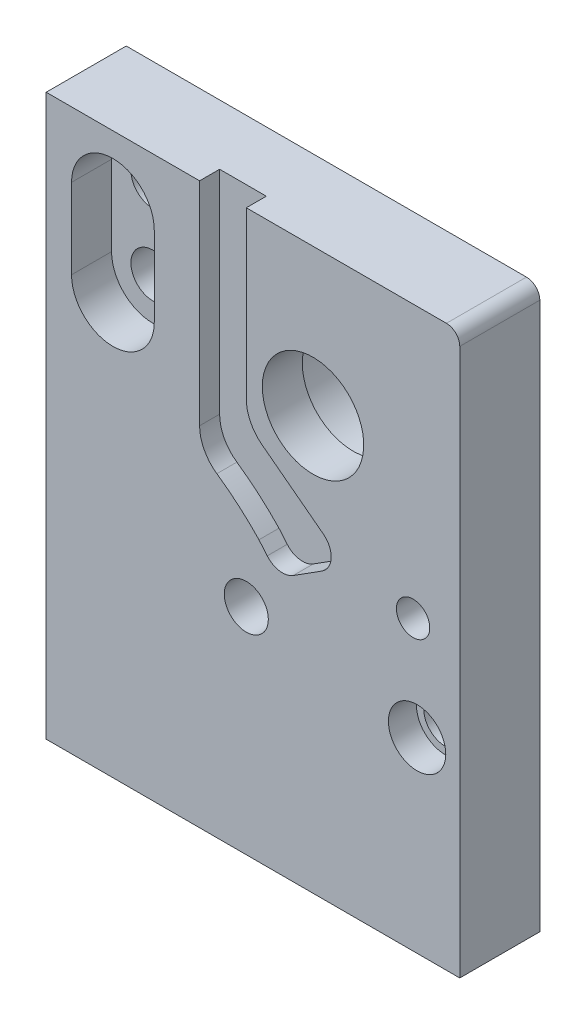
ISO-10303-21;
HEADER;
FILE_DESCRIPTION(('STEP AP214'),'2;1');
FILE_NAME('part.step','',(''),(''),'','','');
FILE_SCHEMA(('AUTOMOTIVE_DESIGN { 1 0 10303 214 1 1 1 1 }'));
ENDSEC;
DATA;
#1=APPLICATION_CONTEXT('core data for automotive mechanical design processes');
#2=APPLICATION_PROTOCOL_DEFINITION('international standard','automotive_design',2000,#1);
#3=PRODUCT_CONTEXT('',#1,'mechanical');
#4=PRODUCT('Part','Part','',(#3));
#5=PRODUCT_RELATED_PRODUCT_CATEGORY('part','',(#4));
#6=PRODUCT_DEFINITION_FORMATION('','',#4);
#7=PRODUCT_DEFINITION_CONTEXT('part definition',#1,'design');
#8=PRODUCT_DEFINITION('design','',#6,#7);
#9=PRODUCT_DEFINITION_SHAPE('','',#8);
#10=(LENGTH_UNIT() NAMED_UNIT(*) SI_UNIT(.MILLI.,.METRE.));
#11=(NAMED_UNIT(*) PLANE_ANGLE_UNIT() SI_UNIT($,.RADIAN.));
#12=(NAMED_UNIT(*) SI_UNIT($,.STERADIAN.) SOLID_ANGLE_UNIT());
#13=UNCERTAINTY_MEASURE_WITH_UNIT(LENGTH_MEASURE(1.E-05),#10,'distance_accuracy_value','');
#14=(GEOMETRIC_REPRESENTATION_CONTEXT(3) GLOBAL_UNCERTAINTY_ASSIGNED_CONTEXT((#13)) GLOBAL_UNIT_ASSIGNED_CONTEXT((#10,
#11,#12)) REPRESENTATION_CONTEXT('',''));
#15=CARTESIAN_POINT('',(0.,0.,0.));
#16=DIRECTION('',(0.,0.,1.));
#17=DIRECTION('',(1.,0.,0.));
#18=AXIS2_PLACEMENT_3D('',#15,#16,#17);
#19=CARTESIAN_POINT('',(20.,31.,6.001));
#20=DIRECTION('',(0.,0.,-1.));
#21=DIRECTION('',(-1.,0.,0.));
#22=AXIS2_PLACEMENT_3D('',#19,#20,#21);
#23=CYLINDRICAL_SURFACE('',#22,3.8);
#24=CARTESIAN_POINT('',(20.,31.,6.));
#25=DIRECTION('',(0.,0.,-1.));
#26=DIRECTION('',(-1.,0.,0.));
#27=AXIS2_PLACEMENT_3D('',#24,#25,#26);
#28=CIRCLE('',#27,3.8);
#29=CARTESIAN_POINT('',(16.2,31.,6.));
#30=VERTEX_POINT('',#29);
#31=EDGE_CURVE('E264',#30,#30,#28,.F.);
#32=CARTESIAN_POINT('',(20.,31.,3.));
#33=DIRECTION('',(0.,0.,-1.));
#34=DIRECTION('',(-1.,0.,0.));
#35=AXIS2_PLACEMENT_3D('',#32,#33,#34);
#36=CIRCLE('',#35,3.8);
#37=CARTESIAN_POINT('',(16.2,31.,3.));
#38=VERTEX_POINT('',#37);
#39=EDGE_CURVE('E249',#38,#38,#36,.T.);
#40=CARTESIAN_POINT('',(16.2,31.,6.));
#41=CARTESIAN_POINT('',(16.2,31.,5.96875));
#42=CARTESIAN_POINT('',(16.2,31.,5.9375));
#43=CARTESIAN_POINT('',(16.2,31.,5.875));
#44=CARTESIAN_POINT('',(16.2,31.,5.84375));
#45=CARTESIAN_POINT('',(16.2,31.,5.78125));
#46=CARTESIAN_POINT('',(16.2,31.,5.75));
#47=CARTESIAN_POINT('',(16.2,31.,5.6875));
#48=CARTESIAN_POINT('',(16.2,31.,5.65625));
#49=CARTESIAN_POINT('',(16.2,31.,5.59375));
#50=CARTESIAN_POINT('',(16.2,31.,5.5625));
#51=CARTESIAN_POINT('',(16.2,31.,5.5));
#52=CARTESIAN_POINT('',(16.2,31.,5.46875));
#53=CARTESIAN_POINT('',(16.2,31.,5.40625));
#54=CARTESIAN_POINT('',(16.2,31.,5.375));
#55=CARTESIAN_POINT('',(16.2,31.,5.3125));
#56=CARTESIAN_POINT('',(16.2,31.,5.28125));
#57=CARTESIAN_POINT('',(16.2,31.,5.21875));
#58=CARTESIAN_POINT('',(16.2,31.,5.1875));
#59=CARTESIAN_POINT('',(16.2,31.,5.125));
#60=CARTESIAN_POINT('',(16.2,31.,5.09375));
#61=CARTESIAN_POINT('',(16.2,31.,5.03125));
#62=CARTESIAN_POINT('',(16.2,31.,5.));
#63=CARTESIAN_POINT('',(16.2,31.,4.9375));
#64=CARTESIAN_POINT('',(16.2,31.,4.90625));
#65=CARTESIAN_POINT('',(16.2,31.,4.84375));
#66=CARTESIAN_POINT('',(16.2,31.,4.8125));
#67=CARTESIAN_POINT('',(16.2,31.,4.75));
#68=CARTESIAN_POINT('',(16.2,31.,4.71875));
#69=CARTESIAN_POINT('',(16.2,31.,4.65625));
#70=CARTESIAN_POINT('',(16.2,31.,4.625));
#71=CARTESIAN_POINT('',(16.2,31.,4.5625));
#72=CARTESIAN_POINT('',(16.2,31.,4.53125));
#73=CARTESIAN_POINT('',(16.2,31.,4.46875));
#74=CARTESIAN_POINT('',(16.2,31.,4.4375));
#75=CARTESIAN_POINT('',(16.2,31.,4.375));
#76=CARTESIAN_POINT('',(16.2,31.,4.34375));
#77=CARTESIAN_POINT('',(16.2,31.,4.28125));
#78=CARTESIAN_POINT('',(16.2,31.,4.25));
#79=CARTESIAN_POINT('',(16.2,31.,4.1875));
#80=CARTESIAN_POINT('',(16.2,31.,4.15625));
#81=CARTESIAN_POINT('',(16.2,31.,4.09375));
#82=CARTESIAN_POINT('',(16.2,31.,4.0625));
#83=CARTESIAN_POINT('',(16.2,31.,4.));
#84=CARTESIAN_POINT('',(16.2,31.,3.96875));
#85=CARTESIAN_POINT('',(16.2,31.,3.90625));
#86=CARTESIAN_POINT('',(16.2,31.,3.875));
#87=CARTESIAN_POINT('',(16.2,31.,3.8125));
#88=CARTESIAN_POINT('',(16.2,31.,3.78125));
#89=CARTESIAN_POINT('',(16.2,31.,3.71875));
#90=CARTESIAN_POINT('',(16.2,31.,3.6875));
#91=CARTESIAN_POINT('',(16.2,31.,3.625));
#92=CARTESIAN_POINT('',(16.2,31.,3.59375));
#93=CARTESIAN_POINT('',(16.2,31.,3.53125));
#94=CARTESIAN_POINT('',(16.2,31.,3.5));
#95=CARTESIAN_POINT('',(16.2,31.,3.4375));
#96=CARTESIAN_POINT('',(16.2,31.,3.40625));
#97=CARTESIAN_POINT('',(16.2,31.,3.34375));
#98=CARTESIAN_POINT('',(16.2,31.,3.3125));
#99=CARTESIAN_POINT('',(16.2,31.,3.25));
#100=CARTESIAN_POINT('',(16.2,31.,3.21875));
#101=CARTESIAN_POINT('',(16.2,31.,3.15625));
#102=CARTESIAN_POINT('',(16.2,31.,3.125));
#103=CARTESIAN_POINT('',(16.2,31.,3.0625));
#104=CARTESIAN_POINT('',(16.2,31.,3.03125));
#105=CARTESIAN_POINT('',(16.2,31.,3.));
#106=B_SPLINE_CURVE_WITH_KNOTS('',3,(#40,#41,#42,#43,#44,#45,#46,#47,#48,#49,#50,#51,#52,#53,
#54,#55,#56,#57,#58,#59,#60,#61,#62,#63,#64,#65,#66,#67,#68,#69,#70,#71,#72,#73,#74,#75,#76,#77,
#78,#79,#80,#81,#82,#83,#84,#85,#86,#87,#88,#89,#90,#91,#92,#93,#94,#95,#96,#97,#98,#99,#100,
#101,#102,#103,#104,#105),.UNSPECIFIED.,.F.,.F.,(4,2,2,2,2,2,2,2,2,2,2,2,2,2,2,2,2,2,2,2,2,2,2,
2,2,2,2,2,2,2,2,2,4),(0.,0.0937500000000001,0.1875,0.28125,0.375,0.46875,0.5625,
0.656250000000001,0.750000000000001,0.843750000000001,0.937500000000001,1.03125,1.125,1.21875,
1.3125,1.40625,1.5,1.59375,1.6875,1.78125,1.875,1.96875,2.0625,2.15625,2.25,2.34375,2.4375,
2.53125,2.625,2.71875,2.8125,2.90625,3.),.UNSPECIFIED.);
#107=EDGE_CURVE('BSEAM37',#30,#38,#106,.T.);
#108=ORIENTED_EDGE('',*,*,#31,.T.);
#109=ORIENTED_EDGE('',*,*,#39,.T.);
#110=ORIENTED_EDGE('',*,*,#107,.T.);
#111=ORIENTED_EDGE('',*,*,#107,.F.);
#112=EDGE_LOOP('',(#108,#110,#109,#111));
#113=FACE_BOUND('',#112,.T.);
#114=ADVANCED_FACE('F37',(#113),#23,.F.);
#115=CARTESIAN_POINT('',(27.8,14.,-0.00100000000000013));
#116=DIRECTION('',(0.,0.,1.));
#117=DIRECTION('',(1.,0.,0.));
#118=AXIS2_PLACEMENT_3D('',#115,#116,#117);
#119=CYLINDRICAL_SURFACE('',#118,1.6);
#120=CARTESIAN_POINT('',(27.8,14.,0.));
#121=DIRECTION('',(0.,0.,-1.));
#122=DIRECTION('',(-1.,0.,0.));
#123=AXIS2_PLACEMENT_3D('',#120,#121,#122);
#124=CIRCLE('',#123,1.6);
#125=CARTESIAN_POINT('',(29.4,14.,0.));
#126=VERTEX_POINT('',#125);
#127=EDGE_CURVE('E276',#126,#126,#124,.F.);
#128=CARTESIAN_POINT('',(27.8,14.,3.9));
#129=DIRECTION('',(0.,0.,1.));
#130=DIRECTION('',(1.,0.,0.));
#131=AXIS2_PLACEMENT_3D('',#128,#129,#130);
#132=CIRCLE('',#131,1.6);
#133=CARTESIAN_POINT('',(29.4,14.,3.9));
#134=VERTEX_POINT('',#133);
#135=EDGE_CURVE('E269',#134,#134,#132,.T.);
#136=CARTESIAN_POINT('',(29.4,14.,0.));
#137=CARTESIAN_POINT('',(29.4,14.,0.040625));
#138=CARTESIAN_POINT('',(29.4,14.,0.08125));
#139=CARTESIAN_POINT('',(29.4,14.,0.1625));
#140=CARTESIAN_POINT('',(29.4,14.,0.203125));
#141=CARTESIAN_POINT('',(29.4,14.,0.284375));
#142=CARTESIAN_POINT('',(29.4,14.,0.325));
#143=CARTESIAN_POINT('',(29.4,14.,0.40625));
#144=CARTESIAN_POINT('',(29.4,14.,0.446875));
#145=CARTESIAN_POINT('',(29.4,14.,0.528125));
#146=CARTESIAN_POINT('',(29.4,14.,0.56875));
#147=CARTESIAN_POINT('',(29.4,14.,0.65));
#148=CARTESIAN_POINT('',(29.4,14.,0.690625));
#149=CARTESIAN_POINT('',(29.4,14.,0.771875));
#150=CARTESIAN_POINT('',(29.4,14.,0.8125));
#151=CARTESIAN_POINT('',(29.4,14.,0.89375));
#152=CARTESIAN_POINT('',(29.4,14.,0.934375));
#153=CARTESIAN_POINT('',(29.4,14.,1.015625));
#154=CARTESIAN_POINT('',(29.4,14.,1.05625));
#155=CARTESIAN_POINT('',(29.4,14.,1.1375));
#156=CARTESIAN_POINT('',(29.4,14.,1.178125));
#157=CARTESIAN_POINT('',(29.4,14.,1.259375));
#158=CARTESIAN_POINT('',(29.4,14.,1.3));
#159=CARTESIAN_POINT('',(29.4,14.,1.38125));
#160=CARTESIAN_POINT('',(29.4,14.,1.421875));
#161=CARTESIAN_POINT('',(29.4,14.,1.503125));
#162=CARTESIAN_POINT('',(29.4,14.,1.54375));
#163=CARTESIAN_POINT('',(29.4,14.,1.625));
#164=CARTESIAN_POINT('',(29.4,14.,1.665625));
#165=CARTESIAN_POINT('',(29.4,14.,1.746875));
#166=CARTESIAN_POINT('',(29.4,14.,1.7875));
#167=CARTESIAN_POINT('',(29.4,14.,1.86875));
#168=CARTESIAN_POINT('',(29.4,14.,1.909375));
#169=CARTESIAN_POINT('',(29.4,14.,1.990625));
#170=CARTESIAN_POINT('',(29.4,14.,2.03125));
#171=CARTESIAN_POINT('',(29.4,14.,2.1125));
#172=CARTESIAN_POINT('',(29.4,14.,2.153125));
#173=CARTESIAN_POINT('',(29.4,14.,2.234375));
#174=CARTESIAN_POINT('',(29.4,14.,2.275));
#175=CARTESIAN_POINT('',(29.4,14.,2.35625));
#176=CARTESIAN_POINT('',(29.4,14.,2.396875));
#177=CARTESIAN_POINT('',(29.4,14.,2.478125));
#178=CARTESIAN_POINT('',(29.4,14.,2.51875));
#179=CARTESIAN_POINT('',(29.4,14.,2.6));
#180=CARTESIAN_POINT('',(29.4,14.,2.640625));
#181=CARTESIAN_POINT('',(29.4,14.,2.721875));
#182=CARTESIAN_POINT('',(29.4,14.,2.7625));
#183=CARTESIAN_POINT('',(29.4,14.,2.84375));
#184=CARTESIAN_POINT('',(29.4,14.,2.884375));
#185=CARTESIAN_POINT('',(29.4,14.,2.965625));
#186=CARTESIAN_POINT('',(29.4,14.,3.00625));
#187=CARTESIAN_POINT('',(29.4,14.,3.0875));
#188=CARTESIAN_POINT('',(29.4,14.,3.128125));
#189=CARTESIAN_POINT('',(29.4,14.,3.209375));
#190=CARTESIAN_POINT('',(29.4,14.,3.25));
#191=CARTESIAN_POINT('',(29.4,14.,3.33125));
#192=CARTESIAN_POINT('',(29.4,14.,3.371875));
#193=CARTESIAN_POINT('',(29.4,14.,3.453125));
#194=CARTESIAN_POINT('',(29.4,14.,3.49375));
#195=CARTESIAN_POINT('',(29.4,14.,3.575));
#196=CARTESIAN_POINT('',(29.4,14.,3.615625));
#197=CARTESIAN_POINT('',(29.4,14.,3.696875));
#198=CARTESIAN_POINT('',(29.4,14.,3.7375));
#199=CARTESIAN_POINT('',(29.4,14.,3.81875));
#200=CARTESIAN_POINT('',(29.4,14.,3.859375));
#201=CARTESIAN_POINT('',(29.4,14.,3.9));
#202=B_SPLINE_CURVE_WITH_KNOTS('',3,(#136,#137,#138,#139,#140,#141,#142,#143,#144,#145,#146,
#147,#148,#149,#150,#151,#152,#153,#154,#155,#156,#157,#158,#159,#160,#161,#162,#163,#164,#165,
#166,#167,#168,#169,#170,#171,#172,#173,#174,#175,#176,#177,#178,#179,#180,#181,#182,#183,#184,
#185,#186,#187,#188,#189,#190,#191,#192,#193,#194,#195,#196,#197,#198,#199,#200,#201),
.UNSPECIFIED.,.F.,.F.,(4,2,2,2,2,2,2,2,2,2,2,2,2,2,2,2,2,2,2,2,2,2,2,2,2,2,2,2,2,2,2,2,4),(0.,
0.121875,0.24375,0.365625,0.4875,0.609375,0.73125,0.853125,0.975,1.096875,1.21875,1.340625,
1.4625,1.584375,1.70625,1.828125,1.95,2.071875,2.19375,2.315625,2.4375,2.559375,2.68125,
2.803125,2.925,3.046875,3.16875,3.290625,3.4125,3.534375,3.65625,3.778125,3.9),.UNSPECIFIED.);
#203=EDGE_CURVE('BSEAM433',#126,#134,#202,.T.);
#204=ORIENTED_EDGE('',*,*,#127,.F.);
#205=ORIENTED_EDGE('',*,*,#135,.T.);
#206=ORIENTED_EDGE('',*,*,#203,.T.);
#207=ORIENTED_EDGE('',*,*,#203,.F.);
#208=EDGE_LOOP('',(#204,#206,#205,#207));
#209=FACE_BOUND('',#208,.T.);
#210=ADVANCED_FACE('F433',(#209),#119,.F.);
#211=CARTESIAN_POINT('',(5.00000000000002,31.1,-0.00100000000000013));
#212=DIRECTION('',(0.,0.,1.));
#213=DIRECTION('',(1.,0.,0.));
#214=AXIS2_PLACEMENT_3D('',#211,#212,#213);
#215=CYLINDRICAL_SURFACE('',#214,1.65);
#216=CARTESIAN_POINT('',(5.00000000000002,31.1,0.));
#217=DIRECTION('',(0.,0.,-1.));
#218=DIRECTION('',(-1.,0.,0.));
#219=AXIS2_PLACEMENT_3D('',#216,#217,#218);
#220=CIRCLE('',#219,1.65);
#221=CARTESIAN_POINT('',(6.65000000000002,31.1,0.));
#222=VERTEX_POINT('',#221);
#223=EDGE_CURVE('E313',#222,#222,#220,.F.);
#224=CARTESIAN_POINT('',(5.00000000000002,31.1,3.));
#225=DIRECTION('',(0.,0.,1.));
#226=DIRECTION('',(1.,0.,0.));
#227=AXIS2_PLACEMENT_3D('',#224,#225,#226);
#228=CIRCLE('',#227,1.65);
#229=CARTESIAN_POINT('',(6.65000000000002,31.1,3.));
#230=VERTEX_POINT('',#229);
#231=EDGE_CURVE('E284',#230,#230,#228,.T.);
#232=CARTESIAN_POINT('',(6.65000000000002,31.1,0.));
#233=CARTESIAN_POINT('',(6.65000000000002,31.1,0.03125));
#234=CARTESIAN_POINT('',(6.65000000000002,31.1,0.0625));
#235=CARTESIAN_POINT('',(6.65000000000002,31.1,0.125));
#236=CARTESIAN_POINT('',(6.65000000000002,31.1,0.15625));
#237=CARTESIAN_POINT('',(6.65000000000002,31.1,0.21875));
#238=CARTESIAN_POINT('',(6.65000000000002,31.1,0.25));
#239=CARTESIAN_POINT('',(6.65000000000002,31.1,0.3125));
#240=CARTESIAN_POINT('',(6.65000000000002,31.1,0.34375));
#241=CARTESIAN_POINT('',(6.65000000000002,31.1,0.40625));
#242=CARTESIAN_POINT('',(6.65000000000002,31.1,0.4375));
#243=CARTESIAN_POINT('',(6.65000000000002,31.1,0.5));
#244=CARTESIAN_POINT('',(6.65000000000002,31.1,0.53125));
#245=CARTESIAN_POINT('',(6.65000000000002,31.1,0.59375));
#246=CARTESIAN_POINT('',(6.65000000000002,31.1,0.625));
#247=CARTESIAN_POINT('',(6.65000000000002,31.1,0.6875));
#248=CARTESIAN_POINT('',(6.65000000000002,31.1,0.71875));
#249=CARTESIAN_POINT('',(6.65000000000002,31.1,0.78125));
#250=CARTESIAN_POINT('',(6.65000000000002,31.1,0.8125));
#251=CARTESIAN_POINT('',(6.65000000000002,31.1,0.875));
#252=CARTESIAN_POINT('',(6.65000000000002,31.1,0.90625));
#253=CARTESIAN_POINT('',(6.65000000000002,31.1,0.96875));
#254=CARTESIAN_POINT('',(6.65000000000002,31.1,1.));
#255=CARTESIAN_POINT('',(6.65000000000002,31.1,1.0625));
#256=CARTESIAN_POINT('',(6.65000000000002,31.1,1.09375));
#257=CARTESIAN_POINT('',(6.65000000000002,31.1,1.15625));
#258=CARTESIAN_POINT('',(6.65000000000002,31.1,1.1875));
#259=CARTESIAN_POINT('',(6.65000000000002,31.1,1.25));
#260=CARTESIAN_POINT('',(6.65000000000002,31.1,1.28125));
#261=CARTESIAN_POINT('',(6.65000000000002,31.1,1.34375));
#262=CARTESIAN_POINT('',(6.65000000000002,31.1,1.375));
#263=CARTESIAN_POINT('',(6.65000000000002,31.1,1.4375));
#264=CARTESIAN_POINT('',(6.65000000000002,31.1,1.46875));
#265=CARTESIAN_POINT('',(6.65000000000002,31.1,1.53125));
#266=CARTESIAN_POINT('',(6.65000000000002,31.1,1.5625));
#267=CARTESIAN_POINT('',(6.65000000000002,31.1,1.625));
#268=CARTESIAN_POINT('',(6.65000000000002,31.1,1.65625));
#269=CARTESIAN_POINT('',(6.65000000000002,31.1,1.71875));
#270=CARTESIAN_POINT('',(6.65000000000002,31.1,1.75));
#271=CARTESIAN_POINT('',(6.65000000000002,31.1,1.8125));
#272=CARTESIAN_POINT('',(6.65000000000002,31.1,1.84375));
#273=CARTESIAN_POINT('',(6.65000000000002,31.1,1.90625));
#274=CARTESIAN_POINT('',(6.65000000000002,31.1,1.9375));
#275=CARTESIAN_POINT('',(6.65000000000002,31.1,2.));
#276=CARTESIAN_POINT('',(6.65000000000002,31.1,2.03125));
#277=CARTESIAN_POINT('',(6.65000000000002,31.1,2.09375));
#278=CARTESIAN_POINT('',(6.65000000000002,31.1,2.125));
#279=CARTESIAN_POINT('',(6.65000000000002,31.1,2.1875));
#280=CARTESIAN_POINT('',(6.65000000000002,31.1,2.21875));
#281=CARTESIAN_POINT('',(6.65000000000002,31.1,2.28125));
#282=CARTESIAN_POINT('',(6.65000000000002,31.1,2.3125));
#283=CARTESIAN_POINT('',(6.65000000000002,31.1,2.375));
#284=CARTESIAN_POINT('',(6.65000000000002,31.1,2.40625));
#285=CARTESIAN_POINT('',(6.65000000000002,31.1,2.46875));
#286=CARTESIAN_POINT('',(6.65000000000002,31.1,2.5));
#287=CARTESIAN_POINT('',(6.65000000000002,31.1,2.5625));
#288=CARTESIAN_POINT('',(6.65000000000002,31.1,2.59375));
#289=CARTESIAN_POINT('',(6.65000000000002,31.1,2.65625));
#290=CARTESIAN_POINT('',(6.65000000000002,31.1,2.6875));
#291=CARTESIAN_POINT('',(6.65000000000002,31.1,2.75));
#292=CARTESIAN_POINT('',(6.65000000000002,31.1,2.78125));
#293=CARTESIAN_POINT('',(6.65000000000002,31.1,2.84375));
#294=CARTESIAN_POINT('',(6.65000000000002,31.1,2.875));
#295=CARTESIAN_POINT('',(6.65000000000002,31.1,2.9375));
#296=CARTESIAN_POINT('',(6.65000000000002,31.1,2.96875));
#297=CARTESIAN_POINT('',(6.65000000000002,31.1,3.));
#298=B_SPLINE_CURVE_WITH_KNOTS('',3,(#232,#233,#234,#235,#236,#237,#238,#239,#240,#241,#242,
#243,#244,#245,#246,#247,#248,#249,#250,#251,#252,#253,#254,#255,#256,#257,#258,#259,#260,#261,
#262,#263,#264,#265,#266,#267,#268,#269,#270,#271,#272,#273,#274,#275,#276,#277,#278,#279,#280,
#281,#282,#283,#284,#285,#286,#287,#288,#289,#290,#291,#292,#293,#294,#295,#296,#297),
.UNSPECIFIED.,.F.,.F.,(4,2,2,2,2,2,2,2,2,2,2,2,2,2,2,2,2,2,2,2,2,2,2,2,2,2,2,2,2,2,2,2,4),(0.,
0.09375,0.1875,0.28125,0.375,0.46875,0.5625,0.65625,0.75,0.84375,0.9375,1.03125,1.125,1.21875,
1.3125,1.40625,1.5,1.59375,1.6875,1.78125,1.875,1.96875,2.0625,2.15625,2.25,2.34375,2.4375,
2.53125,2.625,2.71875,2.8125,2.90625,3.),.UNSPECIFIED.);
#299=EDGE_CURVE('BSEAM439',#222,#230,#298,.T.);
#300=ORIENTED_EDGE('',*,*,#223,.F.);
#301=ORIENTED_EDGE('',*,*,#231,.T.);
#302=ORIENTED_EDGE('',*,*,#299,.T.);
#303=ORIENTED_EDGE('',*,*,#299,.F.);
#304=EDGE_LOOP('',(#300,#302,#301,#303));
#305=FACE_BOUND('',#304,.T.);
#306=ADVANCED_FACE('F439',(#305),#215,.F.);
#307=CARTESIAN_POINT('',(5.00000000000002,37.1,-0.00100000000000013));
#308=DIRECTION('',(0.,0.,1.));
#309=DIRECTION('',(1.,0.,0.));
#310=AXIS2_PLACEMENT_3D('',#307,#308,#309);
#311=CYLINDRICAL_SURFACE('',#310,1.65);
#312=CARTESIAN_POINT('',(5.00000000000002,37.1,0.));
#313=DIRECTION('',(0.,0.,-1.));
#314=DIRECTION('',(-1.,0.,0.));
#315=AXIS2_PLACEMENT_3D('',#312,#313,#314);
#316=CIRCLE('',#315,1.65);
#317=CARTESIAN_POINT('',(6.65000000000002,37.1,0.));
#318=VERTEX_POINT('',#317);
#319=EDGE_CURVE('E320',#318,#318,#316,.F.);
#320=CARTESIAN_POINT('',(5.00000000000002,37.1,3.));
#321=DIRECTION('',(0.,0.,1.));
#322=DIRECTION('',(1.,0.,0.));
#323=AXIS2_PLACEMENT_3D('',#320,#321,#322);
#324=CIRCLE('',#323,1.65);
#325=CARTESIAN_POINT('',(6.65000000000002,37.1,3.));
#326=VERTEX_POINT('',#325);
#327=EDGE_CURVE('E281',#326,#326,#324,.T.);
#328=CARTESIAN_POINT('',(6.65000000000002,37.1,0.));
#329=CARTESIAN_POINT('',(6.65000000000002,37.1,0.03125));
#330=CARTESIAN_POINT('',(6.65000000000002,37.1,0.0625));
#331=CARTESIAN_POINT('',(6.65000000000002,37.1,0.125));
#332=CARTESIAN_POINT('',(6.65000000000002,37.1,0.15625));
#333=CARTESIAN_POINT('',(6.65000000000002,37.1,0.21875));
#334=CARTESIAN_POINT('',(6.65000000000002,37.1,0.25));
#335=CARTESIAN_POINT('',(6.65000000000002,37.1,0.3125));
#336=CARTESIAN_POINT('',(6.65000000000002,37.1,0.34375));
#337=CARTESIAN_POINT('',(6.65000000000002,37.1,0.40625));
#338=CARTESIAN_POINT('',(6.65000000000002,37.1,0.4375));
#339=CARTESIAN_POINT('',(6.65000000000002,37.1,0.5));
#340=CARTESIAN_POINT('',(6.65000000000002,37.1,0.53125));
#341=CARTESIAN_POINT('',(6.65000000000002,37.1,0.59375));
#342=CARTESIAN_POINT('',(6.65000000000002,37.1,0.625));
#343=CARTESIAN_POINT('',(6.65000000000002,37.1,0.6875));
#344=CARTESIAN_POINT('',(6.65000000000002,37.1,0.71875));
#345=CARTESIAN_POINT('',(6.65000000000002,37.1,0.78125));
#346=CARTESIAN_POINT('',(6.65000000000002,37.1,0.8125));
#347=CARTESIAN_POINT('',(6.65000000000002,37.1,0.875));
#348=CARTESIAN_POINT('',(6.65000000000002,37.1,0.90625));
#349=CARTESIAN_POINT('',(6.65000000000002,37.1,0.96875));
#350=CARTESIAN_POINT('',(6.65000000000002,37.1,1.));
#351=CARTESIAN_POINT('',(6.65000000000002,37.1,1.0625));
#352=CARTESIAN_POINT('',(6.65000000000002,37.1,1.09375));
#353=CARTESIAN_POINT('',(6.65000000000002,37.1,1.15625));
#354=CARTESIAN_POINT('',(6.65000000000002,37.1,1.1875));
#355=CARTESIAN_POINT('',(6.65000000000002,37.1,1.25));
#356=CARTESIAN_POINT('',(6.65000000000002,37.1,1.28125));
#357=CARTESIAN_POINT('',(6.65000000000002,37.1,1.34375));
#358=CARTESIAN_POINT('',(6.65000000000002,37.1,1.375));
#359=CARTESIAN_POINT('',(6.65000000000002,37.1,1.4375));
#360=CARTESIAN_POINT('',(6.65000000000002,37.1,1.46875));
#361=CARTESIAN_POINT('',(6.65000000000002,37.1,1.53125));
#362=CARTESIAN_POINT('',(6.65000000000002,37.1,1.5625));
#363=CARTESIAN_POINT('',(6.65000000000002,37.1,1.625));
#364=CARTESIAN_POINT('',(6.65000000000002,37.1,1.65625));
#365=CARTESIAN_POINT('',(6.65000000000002,37.1,1.71875));
#366=CARTESIAN_POINT('',(6.65000000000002,37.1,1.75));
#367=CARTESIAN_POINT('',(6.65000000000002,37.1,1.8125));
#368=CARTESIAN_POINT('',(6.65000000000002,37.1,1.84375));
#369=CARTESIAN_POINT('',(6.65000000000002,37.1,1.90625));
#370=CARTESIAN_POINT('',(6.65000000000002,37.1,1.9375));
#371=CARTESIAN_POINT('',(6.65000000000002,37.1,2.));
#372=CARTESIAN_POINT('',(6.65000000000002,37.1,2.03125));
#373=CARTESIAN_POINT('',(6.65000000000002,37.1,2.09375));
#374=CARTESIAN_POINT('',(6.65000000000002,37.1,2.125));
#375=CARTESIAN_POINT('',(6.65000000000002,37.1,2.1875));
#376=CARTESIAN_POINT('',(6.65000000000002,37.1,2.21875));
#377=CARTESIAN_POINT('',(6.65000000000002,37.1,2.28125));
#378=CARTESIAN_POINT('',(6.65000000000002,37.1,2.3125));
#379=CARTESIAN_POINT('',(6.65000000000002,37.1,2.375));
#380=CARTESIAN_POINT('',(6.65000000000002,37.1,2.40625));
#381=CARTESIAN_POINT('',(6.65000000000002,37.1,2.46875));
#382=CARTESIAN_POINT('',(6.65000000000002,37.1,2.5));
#383=CARTESIAN_POINT('',(6.65000000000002,37.1,2.5625));
#384=CARTESIAN_POINT('',(6.65000000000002,37.1,2.59375));
#385=CARTESIAN_POINT('',(6.65000000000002,37.1,2.65625));
#386=CARTESIAN_POINT('',(6.65000000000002,37.1,2.6875));
#387=CARTESIAN_POINT('',(6.65000000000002,37.1,2.75));
#388=CARTESIAN_POINT('',(6.65000000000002,37.1,2.78125));
#389=CARTESIAN_POINT('',(6.65000000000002,37.1,2.84375));
#390=CARTESIAN_POINT('',(6.65000000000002,37.1,2.875));
#391=CARTESIAN_POINT('',(6.65000000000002,37.1,2.9375));
#392=CARTESIAN_POINT('',(6.65000000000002,37.1,2.96875));
#393=CARTESIAN_POINT('',(6.65000000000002,37.1,3.));
#394=B_SPLINE_CURVE_WITH_KNOTS('',3,(#328,#329,#330,#331,#332,#333,#334,#335,#336,#337,#338,
#339,#340,#341,#342,#343,#344,#345,#346,#347,#348,#349,#350,#351,#352,#353,#354,#355,#356,#357,
#358,#359,#360,#361,#362,#363,#364,#365,#366,#367,#368,#369,#370,#371,#372,#373,#374,#375,#376,
#377,#378,#379,#380,#381,#382,#383,#384,#385,#386,#387,#388,#389,#390,#391,#392,#393),
.UNSPECIFIED.,.F.,.F.,(4,2,2,2,2,2,2,2,2,2,2,2,2,2,2,2,2,2,2,2,2,2,2,2,2,2,2,2,2,2,2,2,4),(0.,
0.09375,0.1875,0.28125,0.375,0.46875,0.5625,0.65625,0.75,0.84375,0.9375,1.03125,1.125,1.21875,
1.3125,1.40625,1.5,1.59375,1.6875,1.78125,1.875,1.96875,2.0625,2.15625,2.25,2.34375,2.4375,
2.53125,2.625,2.71875,2.8125,2.90625,3.),.UNSPECIFIED.);
#395=EDGE_CURVE('BSEAM476',#318,#326,#394,.T.);
#396=ORIENTED_EDGE('',*,*,#319,.F.);
#397=ORIENTED_EDGE('',*,*,#327,.T.);
#398=ORIENTED_EDGE('',*,*,#395,.T.);
#399=ORIENTED_EDGE('',*,*,#395,.F.);
#400=EDGE_LOOP('',(#396,#398,#397,#399));
#401=FACE_BOUND('',#400,.T.);
#402=ADVANCED_FACE('F476',(#401),#311,.F.);
#403=CARTESIAN_POINT('',(0.,0.,6.));
#404=DIRECTION('',(1.,0.,0.));
#405=DIRECTION('',(0.,0.,-1.));
#406=AXIS2_PLACEMENT_3D('',#403,#404,#405);
#407=PLANE('',#406);
#408=DIRECTION('',(0.,-1.,0.));
#409=VECTOR('',#408,1.);
#410=CARTESIAN_POINT('',(0.,0.,0.));
#411=LINE('',#410,#409);
#412=CARTESIAN_POINT('',(0.,42.,0.));
#413=VERTEX_POINT('',#412);
#414=CARTESIAN_POINT('',(0.,0.,0.));
#415=VERTEX_POINT('',#414);
#416=EDGE_CURVE('E329',#413,#415,#411,.T.);
#417=ORIENTED_EDGE('',*,*,#416,.T.);
#418=DIRECTION('',(0.,0.,-1.));
#419=VECTOR('',#418,1.);
#420=CARTESIAN_POINT('',(0.,0.,6.));
#421=LINE('',#420,#419);
#422=CARTESIAN_POINT('',(0.,0.,6.));
#423=VERTEX_POINT('',#422);
#424=EDGE_CURVE('E365',#423,#415,#421,.T.);
#425=ORIENTED_EDGE('',*,*,#424,.F.);
#426=DIRECTION('',(0.,-1.,0.));
#427=VECTOR('',#426,1.);
#428=CARTESIAN_POINT('',(0.,0.,6.));
#429=LINE('',#428,#427);
#430=CARTESIAN_POINT('',(0.,42.,6.));
#431=VERTEX_POINT('',#430);
#432=EDGE_CURVE('E338',#431,#423,#429,.T.);
#433=ORIENTED_EDGE('',*,*,#432,.F.);
#434=DIRECTION('',(0.,0.,-1.));
#435=VECTOR('',#434,1.);
#436=CARTESIAN_POINT('',(0.,42.,6.));
#437=LINE('',#436,#435);
#438=EDGE_CURVE('E351',#431,#413,#437,.T.);
#439=ORIENTED_EDGE('',*,*,#438,.T.);
#440=EDGE_LOOP('',(#417,#425,#433,#439));
#441=FACE_BOUND('',#440,.T.);
#442=ADVANCED_FACE('F479',(#441),#407,.F.);
#443=CARTESIAN_POINT('',(0.,0.,6.));
#444=DIRECTION('',(0.,1.,0.));
#445=DIRECTION('',(0.,0.,1.));
#446=AXIS2_PLACEMENT_3D('',#443,#444,#445);
#447=PLANE('',#446);
#448=CARTESIAN_POINT('',(9.00000000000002,0.,3.));
#449=DIRECTION('',(0.,-1.,0.));
#450=DIRECTION('',(0.,0.,-1.));
#451=AXIS2_PLACEMENT_3D('',#448,#449,#450);
#452=CIRCLE('',#451,1.3);
#453=CARTESIAN_POINT('',(9.00000000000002,0.,1.7));
#454=VERTEX_POINT('',#453);
#455=EDGE_CURVE('E330',#454,#454,#452,.T.);
#456=ORIENTED_EDGE('',*,*,#455,.F.);
#457=EDGE_LOOP('',(#456));
#458=FACE_BOUND('',#457,.T.);
#459=CARTESIAN_POINT('',(17.6,0.,3.));
#460=DIRECTION('',(0.,-1.,0.));
#461=DIRECTION('',(0.,0.,-1.));
#462=AXIS2_PLACEMENT_3D('',#459,#460,#461);
#463=CIRCLE('',#462,1.29999999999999);
#464=CARTESIAN_POINT('',(17.6,0.,1.70000000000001));
#465=VERTEX_POINT('',#464);
#466=EDGE_CURVE('E323',#465,#465,#463,.T.);
#467=ORIENTED_EDGE('',*,*,#466,.F.);
#468=EDGE_LOOP('',(#467));
#469=FACE_BOUND('',#468,.T.);
#470=DIRECTION('',(1.,0.,0.));
#471=VECTOR('',#470,1.);
#472=CARTESIAN_POINT('',(0.,0.,0.));
#473=LINE('',#472,#471);
#474=CARTESIAN_POINT('',(31.,0.,0.));
#475=VERTEX_POINT('',#474);
#476=EDGE_CURVE('E354',#415,#475,#473,.T.);
#477=ORIENTED_EDGE('',*,*,#476,.T.);
#478=DIRECTION('',(0.,0.,-1.));
#479=VECTOR('',#478,1.);
#480=CARTESIAN_POINT('',(31.,0.,6.));
#481=LINE('',#480,#479);
#482=CARTESIAN_POINT('',(31.,0.,6.));
#483=VERTEX_POINT('',#482);
#484=EDGE_CURVE('E362',#483,#475,#481,.T.);
#485=ORIENTED_EDGE('',*,*,#484,.F.);
#486=DIRECTION('',(1.,0.,0.));
#487=VECTOR('',#486,1.);
#488=CARTESIAN_POINT('',(0.,0.,6.));
#489=LINE('',#488,#487);
#490=EDGE_CURVE('E341',#423,#483,#489,.T.);
#491=ORIENTED_EDGE('',*,*,#490,.F.);
#492=ORIENTED_EDGE('',*,*,#424,.T.);
#493=EDGE_LOOP('',(#477,#485,#491,#492));
#494=FACE_BOUND('',#493,.T.);
#495=ADVANCED_FACE('F512',(#458,#469,#494),#447,.F.);
#496=CARTESIAN_POINT('',(31.,0.,6.));
#497=DIRECTION('',(-1.,0.,0.));
#498=DIRECTION('',(0.,0.,1.));
#499=AXIS2_PLACEMENT_3D('',#496,#497,#498);
#500=PLANE('',#499);
#501=DIRECTION('',(0.,1.,0.));
#502=VECTOR('',#501,1.);
#503=CARTESIAN_POINT('',(31.,0.,0.));
#504=LINE('',#503,#502);
#505=CARTESIAN_POINT('',(31.,41.,0.));
#506=VERTEX_POINT('',#505);
#507=EDGE_CURVE('E356',#475,#506,#504,.T.);
#508=ORIENTED_EDGE('',*,*,#507,.T.);
#509=DIRECTION('',(0.,0.,-1.));
#510=VECTOR('',#509,1.);
#511=CARTESIAN_POINT('',(31.,41.,6.));
#512=LINE('',#511,#510);
#513=CARTESIAN_POINT('',(31.,41.,6.));
#514=VERTEX_POINT('',#513);
#515=EDGE_CURVE('E373',#506,#514,#512,.F.);
#516=ORIENTED_EDGE('',*,*,#515,.T.);
#517=DIRECTION('',(0.,1.,0.));
#518=VECTOR('',#517,1.);
#519=CARTESIAN_POINT('',(31.,0.,6.));
#520=LINE('',#519,#518);
#521=EDGE_CURVE('E344',#483,#514,#520,.T.);
#522=ORIENTED_EDGE('',*,*,#521,.F.);
#523=ORIENTED_EDGE('',*,*,#484,.T.);
#524=EDGE_LOOP('',(#508,#516,#522,#523));
#525=FACE_BOUND('',#524,.T.);
#526=ADVANCED_FACE('F509',(#525),#500,.F.);
#527=CARTESIAN_POINT('',(0.,42.,6.));
#528=DIRECTION('',(0.,-1.,0.));
#529=DIRECTION('',(0.,0.,-1.));
#530=AXIS2_PLACEMENT_3D('',#527,#528,#529);
#531=PLANE('',#530);
#532=DIRECTION('',(-1.,0.,0.));
#533=VECTOR('',#532,1.);
#534=CARTESIAN_POINT('',(11.5,42.,4.5));
#535=LINE('',#534,#533);
#536=CARTESIAN_POINT('',(15.,42.,4.5));
#537=VERTEX_POINT('',#536);
#538=CARTESIAN_POINT('',(11.5,42.,4.5));
#539=VERTEX_POINT('',#538);
#540=EDGE_CURVE('E181',#537,#539,#535,.T.);
#541=ORIENTED_EDGE('',*,*,#540,.F.);
#542=DIRECTION('',(0.,0.,1.));
#543=VECTOR('',#542,1.);
#544=CARTESIAN_POINT('',(15.,42.,4.5));
#545=LINE('',#544,#543);
#546=CARTESIAN_POINT('',(15.,42.,6.));
#547=VERTEX_POINT('',#546);
#548=EDGE_CURVE('E235',#537,#547,#545,.T.);
#549=ORIENTED_EDGE('',*,*,#548,.T.);
#550=DIRECTION('',(-1.,0.,0.));
#551=VECTOR('',#550,1.);
#552=CARTESIAN_POINT('',(0.,42.,6.));
#553=LINE('',#552,#551);
#554=CARTESIAN_POINT('',(30.,42.,6.));
#555=VERTEX_POINT('',#554);
#556=EDGE_CURVE('E348',#555,#547,#553,.T.);
#557=ORIENTED_EDGE('',*,*,#556,.F.);
#558=DIRECTION('',(0.,0.,-1.));
#559=VECTOR('',#558,1.);
#560=CARTESIAN_POINT('',(30.,42.,6.));
#561=LINE('',#560,#559);
#562=CARTESIAN_POINT('',(30.,42.,0.));
#563=VERTEX_POINT('',#562);
#564=EDGE_CURVE('E368',#555,#563,#561,.T.);
#565=ORIENTED_EDGE('',*,*,#564,.T.);
#566=DIRECTION('',(-1.,0.,0.));
#567=VECTOR('',#566,1.);
#568=CARTESIAN_POINT('',(0.,42.,0.));
#569=LINE('',#568,#567);
#570=EDGE_CURVE('E342',#563,#413,#569,.T.);
#571=ORIENTED_EDGE('',*,*,#570,.T.);
#572=ORIENTED_EDGE('',*,*,#438,.F.);
#573=CARTESIAN_POINT('',(11.5,42.,6.));
#574=VERTEX_POINT('',#573);
#575=EDGE_CURVE('E347',#574,#431,#553,.T.);
#576=ORIENTED_EDGE('',*,*,#575,.F.);
#577=DIRECTION('',(0.,0.,1.));
#578=VECTOR('',#577,1.);
#579=CARTESIAN_POINT('',(11.5,42.,4.5));
#580=LINE('',#579,#578);
#581=EDGE_CURVE('E232',#539,#574,#580,.T.);
#582=ORIENTED_EDGE('',*,*,#581,.F.);
#583=EDGE_LOOP('',(#541,#549,#557,#565,#571,#572,#576,#582));
#584=FACE_BOUND('',#583,.T.);
#585=ADVANCED_FACE('F419',(#584),#531,.F.);
#586=CARTESIAN_POINT('',(0.,0.,6.));
#587=DIRECTION('',(0.,0.,-1.));
#588=DIRECTION('',(-1.,0.,0.));
#589=AXIS2_PLACEMENT_3D('',#586,#587,#588);
#590=PLANE('',#589);
#591=CARTESIAN_POINT('',(15.,16.1,6.));
#592=DIRECTION('',(0.,0.,1.));
#593=DIRECTION('',(1.,0.,0.));
#594=AXIS2_PLACEMENT_3D('',#591,#592,#593);
#595=CIRCLE('',#594,1.65);
#596=CARTESIAN_POINT('',(16.65,16.1,6.));
#597=VERTEX_POINT('',#596);
#598=EDGE_CURVE('E246',#597,#597,#595,.T.);
#599=ORIENTED_EDGE('',*,*,#598,.F.);
#600=EDGE_LOOP('',(#599));
#601=FACE_BOUND('',#600,.T.);
#602=CARTESIAN_POINT('',(27.5,21.6,6.));
#603=DIRECTION('',(0.,0.,1.));
#604=DIRECTION('',(1.,0.,0.));
#605=AXIS2_PLACEMENT_3D('',#602,#603,#604);
#606=CIRCLE('',#605,1.25);
#607=CARTESIAN_POINT('',(28.75,21.6,6.));
#608=VERTEX_POINT('',#607);
#609=EDGE_CURVE('E253',#608,#608,#606,.T.);
#610=ORIENTED_EDGE('',*,*,#609,.F.);
#611=EDGE_LOOP('',(#610));
#612=FACE_BOUND('',#611,.T.);
#613=ORIENTED_EDGE('',*,*,#31,.F.);
#614=EDGE_LOOP('',(#613));
#615=FACE_BOUND('',#614,.T.);
#616=CARTESIAN_POINT('',(27.8,14.,6.));
#617=DIRECTION('',(0.,0.,1.));
#618=DIRECTION('',(1.,0.,0.));
#619=AXIS2_PLACEMENT_3D('',#616,#617,#618);
#620=CIRCLE('',#619,2.15);
#621=CARTESIAN_POINT('',(29.95,14.,6.));
#622=VERTEX_POINT('',#621);
#623=EDGE_CURVE('E272',#622,#622,#620,.T.);
#624=ORIENTED_EDGE('',*,*,#623,.F.);
#625=EDGE_LOOP('',(#624));
#626=FACE_BOUND('',#625,.T.);
#627=DIRECTION('',(0.,1.,0.));
#628=VECTOR('',#627,1.);
#629=CARTESIAN_POINT('',(8.10000000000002,31.1,6.));
#630=LINE('',#629,#628);
#631=CARTESIAN_POINT('',(8.10000000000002,31.1,6.));
#632=VERTEX_POINT('',#631);
#633=CARTESIAN_POINT('',(8.10000000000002,37.1,6.));
#634=VERTEX_POINT('',#633);
#635=EDGE_CURVE('E303',#632,#634,#630,.T.);
#636=ORIENTED_EDGE('',*,*,#635,.F.);
#637=CARTESIAN_POINT('',(5.00000000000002,31.1,6.));
#638=DIRECTION('',(0.,0.,1.));
#639=DIRECTION('',(1.,0.,0.));
#640=AXIS2_PLACEMENT_3D('',#637,#638,#639);
#641=CIRCLE('',#640,3.1);
#642=CARTESIAN_POINT('',(1.90000000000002,31.1,6.));
#643=VERTEX_POINT('',#642);
#644=EDGE_CURVE('E287',#643,#632,#641,.T.);
#645=ORIENTED_EDGE('',*,*,#644,.F.);
#646=DIRECTION('',(0.,-1.,0.));
#647=VECTOR('',#646,1.);
#648=CARTESIAN_POINT('',(1.90000000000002,31.1,6.));
#649=LINE('',#648,#647);
#650=CARTESIAN_POINT('',(1.90000000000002,37.1,6.));
#651=VERTEX_POINT('',#650);
#652=EDGE_CURVE('E292',#651,#643,#649,.T.);
#653=ORIENTED_EDGE('',*,*,#652,.F.);
#654=CARTESIAN_POINT('',(5.00000000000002,37.1,6.));
#655=DIRECTION('',(0.,0.,1.));
#656=DIRECTION('',(1.,0.,0.));
#657=AXIS2_PLACEMENT_3D('',#654,#655,#656);
#658=CIRCLE('',#657,3.1);
#659=EDGE_CURVE('E306',#634,#651,#658,.T.);
#660=ORIENTED_EDGE('',*,*,#659,.F.);
#661=EDGE_LOOP('',(#636,#645,#653,#660));
#662=FACE_BOUND('',#661,.T.);
#663=ORIENTED_EDGE('',*,*,#556,.T.);
#664=DIRECTION('',(0.,1.,0.));
#665=VECTOR('',#664,1.);
#666=CARTESIAN_POINT('',(15.,39.1,6.));
#667=LINE('',#666,#665);
#668=CARTESIAN_POINT('',(15.,29.5870583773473,6.));
#669=VERTEX_POINT('',#668);
#670=EDGE_CURVE('E184',#669,#547,#667,.T.);
#671=ORIENTED_EDGE('',*,*,#670,.F.);
#672=CARTESIAN_POINT('',(18.,29.5870583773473,6.));
#673=DIRECTION('',(0.,0.,-1.));
#674=DIRECTION('',(1.,0.,0.));
#675=AXIS2_PLACEMENT_3D('',#672,#673,#674);
#676=CIRCLE('',#675,3.);
#677=CARTESIAN_POINT('',(16.1834493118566,27.1995610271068,6.));
#678=VERTEX_POINT('',#677);
#679=EDGE_CURVE('E228',#678,#669,#676,.T.);
#680=ORIENTED_EDGE('',*,*,#679,.F.);
#681=DIRECTION('',(-0.795832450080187,0.605516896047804,0.));
#682=VECTOR('',#681,1.);
#683=CARTESIAN_POINT('',(16.1834493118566,27.1995610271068,6.));
#684=LINE('',#683,#682);
#685=CARTESIAN_POINT('',(20.770960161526,23.7091085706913,6.));
#686=VERTEX_POINT('',#685);
#687=EDGE_CURVE('E226',#686,#678,#684,.T.);
#688=ORIENTED_EDGE('',*,*,#687,.F.);
#689=CARTESIAN_POINT('',(19.8626848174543,22.5153598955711,6.));
#690=DIRECTION('',(0.,0.,-1.));
#691=DIRECTION('',(-1.,0.,0.));
#692=AXIS2_PLACEMENT_3D('',#689,#690,#691);
#693=CIRCLE('',#692,1.5);
#694=CARTESIAN_POINT('',(20.6660548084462,21.2486331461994,6.));
#695=VERTEX_POINT('',#694);
#696=EDGE_CURVE('E11',#686,#695,#693,.T.);
#697=ORIENTED_EDGE('',*,*,#696,.T.);
#698=DIRECTION('',(0.844484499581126,0.535579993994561,0.));
#699=VECTOR('',#698,1.);
#700=CARTESIAN_POINT('',(17.4113737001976,19.1844838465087,6.));
#701=LINE('',#700,#699);
#702=CARTESIAN_POINT('',(18.517933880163,19.8862746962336,6.));
#703=VERTEX_POINT('',#702);
#704=EDGE_CURVE('E223',#703,#695,#701,.T.);
#705=ORIENTED_EDGE('',*,*,#704,.F.);
#706=CARTESIAN_POINT('',(17.7145638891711,21.1530014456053,6.));
#707=DIRECTION('',(0.,0.,-1.));
#708=DIRECTION('',(-1.,0.,0.));
#709=AXIS2_PLACEMENT_3D('',#706,#707,#708);
#710=CIRCLE('',#709,1.5);
#711=CARTESIAN_POINT('',(16.5672663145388,20.1867156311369,6.));
#712=VERTEX_POINT('',#711);
#713=EDGE_CURVE('E45',#703,#712,#710,.T.);
#714=ORIENTED_EDGE('',*,*,#713,.T.);
#715=DIRECTION('',(0.644190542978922,-0.764865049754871,0.));
#716=VECTOR('',#715,1.);
#717=CARTESIAN_POINT('',(15.9475985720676,20.9224640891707,6.));
#718=LINE('',#717,#716);
#719=CARTESIAN_POINT('',(15.9475985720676,20.9224640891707,6.));
#720=VERTEX_POINT('',#719);
#721=EDGE_CURVE('E220',#720,#712,#718,.T.);
#722=ORIENTED_EDGE('',*,*,#721,.F.);
#723=CARTESIAN_POINT('',(1.4068873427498,7.19046798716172,6.));
#724=DIRECTION('',(0.,0.,-1.));
#725=DIRECTION('',(1.,0.,0.));
#726=AXIS2_PLACEMENT_3D('',#723,#724,#725);
#727=CIRCLE('',#726,20.);
#728=CARTESIAN_POINT('',(12.7922026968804,23.6335393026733,6.));
#729=VERTEX_POINT('',#728);
#730=EDGE_CURVE('E217',#729,#720,#727,.T.);
#731=ORIENTED_EDGE('',*,*,#730,.F.);
#732=CARTESIAN_POINT('',(14.5,26.1,6.));
#733=DIRECTION('',(0.,0.,1.));
#734=DIRECTION('',(1.,0.,0.));
#735=AXIS2_PLACEMENT_3D('',#732,#733,#734);
#736=CIRCLE('',#735,3.);
#737=CARTESIAN_POINT('',(11.5,26.1,6.));
#738=VERTEX_POINT('',#737);
#739=EDGE_CURVE('E215',#738,#729,#736,.T.);
#740=ORIENTED_EDGE('',*,*,#739,.F.);
#741=DIRECTION('',(0.,-1.,0.));
#742=VECTOR('',#741,1.);
#743=CARTESIAN_POINT('',(11.5,26.1,6.));
#744=LINE('',#743,#742);
#745=EDGE_CURVE('E190',#574,#738,#744,.T.);
#746=ORIENTED_EDGE('',*,*,#745,.F.);
#747=ORIENTED_EDGE('',*,*,#575,.T.);
#748=ORIENTED_EDGE('',*,*,#432,.T.);
#749=ORIENTED_EDGE('',*,*,#490,.T.);
#750=ORIENTED_EDGE('',*,*,#521,.T.);
#751=CARTESIAN_POINT('',(30.,41.,6.));
#752=DIRECTION('',(0.,0.,-1.));
#753=DIRECTION('',(-1.,0.,0.));
#754=AXIS2_PLACEMENT_3D('',#751,#752,#753);
#755=CIRCLE('',#754,1.);
#756=EDGE_CURVE('E375',#514,#555,#755,.F.);
#757=ORIENTED_EDGE('',*,*,#756,.T.);
#758=EDGE_LOOP('',(#663,#671,#680,#688,#697,#705,#714,#722,#731,#740,#746,#747,#748,#749,#750,#757));
#759=FACE_BOUND('',#758,.T.);
#760=ADVANCED_FACE('F391',(#601,#612,#615,#626,#662,#759),#590,.F.);
#761=CARTESIAN_POINT('',(0.,0.,0.));
#762=DIRECTION('',(0.,0.,-1.));
#763=DIRECTION('',(-1.,0.,0.));
#764=AXIS2_PLACEMENT_3D('',#761,#762,#763);
#765=PLANE('',#764);
#766=CARTESIAN_POINT('',(15.,16.1,0.));
#767=DIRECTION('',(0.,0.,-1.));
#768=DIRECTION('',(-1.,0.,0.));
#769=AXIS2_PLACEMENT_3D('',#766,#767,#768);
#770=CIRCLE('',#769,1.65);
#771=CARTESIAN_POINT('',(16.65,16.1,0.));
#772=VERTEX_POINT('',#771);
#773=EDGE_CURVE('E250',#772,#772,#770,.F.);
#774=ORIENTED_EDGE('',*,*,#773,.T.);
#775=EDGE_LOOP('',(#774));
#776=FACE_BOUND('',#775,.T.);
#777=CARTESIAN_POINT('',(27.5,21.6,0.));
#778=DIRECTION('',(0.,0.,-1.));
#779=DIRECTION('',(-1.,0.,0.));
#780=AXIS2_PLACEMENT_3D('',#777,#778,#779);
#781=CIRCLE('',#780,1.25);
#782=CARTESIAN_POINT('',(28.75,21.6,0.));
#783=VERTEX_POINT('',#782);
#784=EDGE_CURVE('E234',#783,#783,#781,.F.);
#785=ORIENTED_EDGE('',*,*,#784,.T.);
#786=EDGE_LOOP('',(#785));
#787=FACE_BOUND('',#786,.T.);
#788=CARTESIAN_POINT('',(20.,31.,0.));
#789=DIRECTION('',(0.,0.,-1.));
#790=DIRECTION('',(-1.,0.,0.));
#791=AXIS2_PLACEMENT_3D('',#788,#789,#790);
#792=CIRCLE('',#791,4.55);
#793=CARTESIAN_POINT('',(15.45,31.,0.));
#794=VERTEX_POINT('',#793);
#795=EDGE_CURVE('E260',#794,#794,#792,.T.);
#796=ORIENTED_EDGE('',*,*,#795,.F.);
#797=EDGE_LOOP('',(#796));
#798=FACE_BOUND('',#797,.T.);
#799=ORIENTED_EDGE('',*,*,#127,.T.);
#800=EDGE_LOOP('',(#799));
#801=FACE_BOUND('',#800,.T.);
#802=ORIENTED_EDGE('',*,*,#319,.T.);
#803=EDGE_LOOP('',(#802));
#804=FACE_BOUND('',#803,.T.);
#805=ORIENTED_EDGE('',*,*,#223,.T.);
#806=EDGE_LOOP('',(#805));
#807=FACE_BOUND('',#806,.T.);
#808=ORIENTED_EDGE('',*,*,#570,.F.);
#809=CARTESIAN_POINT('',(30.,41.,0.));
#810=DIRECTION('',(0.,0.,-1.));
#811=DIRECTION('',(-1.,0.,0.));
#812=AXIS2_PLACEMENT_3D('',#809,#810,#811);
#813=CIRCLE('',#812,1.);
#814=EDGE_CURVE('E371',#563,#506,#813,.T.);
#815=ORIENTED_EDGE('',*,*,#814,.T.);
#816=ORIENTED_EDGE('',*,*,#507,.F.);
#817=ORIENTED_EDGE('',*,*,#476,.F.);
#818=ORIENTED_EDGE('',*,*,#416,.F.);
#819=EDGE_LOOP('',(#808,#815,#816,#817,#818));
#820=FACE_BOUND('',#819,.T.);
#821=ADVANCED_FACE('F502',(#776,#787,#798,#801,#804,#807,#820),#765,.T.);
#822=CARTESIAN_POINT('',(30.,41.,6.));
#823=DIRECTION('',(0.,0.,-1.));
#824=DIRECTION('',(-1.,0.,0.));
#825=AXIS2_PLACEMENT_3D('',#822,#823,#824);
#826=CYLINDRICAL_SURFACE('',#825,1.);
#827=ORIENTED_EDGE('',*,*,#756,.F.);
#828=ORIENTED_EDGE('',*,*,#515,.F.);
#829=ORIENTED_EDGE('',*,*,#814,.F.);
#830=ORIENTED_EDGE('',*,*,#564,.F.);
#831=EDGE_LOOP('',(#827,#828,#829,#830));
#832=FACE_BOUND('',#831,.T.);
#833=ADVANCED_FACE('F498',(#832),#826,.T.);
#834=CARTESIAN_POINT('',(17.6,8.,3.));
#835=DIRECTION('',(0.,-1.,0.));
#836=DIRECTION('',(0.,0.,-1.));
#837=AXIS2_PLACEMENT_3D('',#834,#835,#836);
#838=CYLINDRICAL_SURFACE('',#837,1.29999999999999);
#839=CARTESIAN_POINT('',(17.6,8.,3.));
#840=DIRECTION('',(0.,-1.,0.));
#841=DIRECTION('',(0.,0.,-1.));
#842=AXIS2_PLACEMENT_3D('',#839,#840,#841);
#843=CIRCLE('',#842,1.29999999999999);
#844=CARTESIAN_POINT('',(17.6,8.,1.70000000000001));
#845=VERTEX_POINT('',#844);
#846=EDGE_CURVE('E333',#845,#845,#843,.T.);
#847=ORIENTED_EDGE('',*,*,#846,.F.);
#848=EDGE_LOOP('',(#847));
#849=FACE_BOUND('',#848,.T.);
#850=ORIENTED_EDGE('',*,*,#466,.T.);
#851=EDGE_LOOP('',(#850));
#852=FACE_BOUND('',#851,.T.);
#853=ADVANCED_FACE('F494',(#849,#852),#838,.F.);
#854=CARTESIAN_POINT('',(17.6,8.,3.));
#855=DIRECTION('',(0.,-1.,0.));
#856=DIRECTION('',(0.,0.,-1.));
#857=AXIS2_PLACEMENT_3D('',#854,#855,#856);
#858=PLANE('',#857);
#859=ORIENTED_EDGE('',*,*,#846,.T.);
#860=EDGE_LOOP('',(#859));
#861=FACE_BOUND('',#860,.T.);
#862=ADVANCED_FACE('F490',(#861),#858,.T.);
#863=CARTESIAN_POINT('',(9.00000000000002,8.,3.));
#864=DIRECTION('',(0.,-1.,0.));
#865=DIRECTION('',(0.,0.,-1.));
#866=AXIS2_PLACEMENT_3D('',#863,#864,#865);
#867=CYLINDRICAL_SURFACE('',#866,1.3);
#868=CARTESIAN_POINT('',(9.00000000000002,8.,3.));
#869=DIRECTION('',(0.,-1.,0.));
#870=DIRECTION('',(0.,0.,-1.));
#871=AXIS2_PLACEMENT_3D('',#868,#869,#870);
#872=CIRCLE('',#871,1.3);
#873=CARTESIAN_POINT('',(9.00000000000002,8.,1.7));
#874=VERTEX_POINT('',#873);
#875=EDGE_CURVE('E326',#874,#874,#872,.T.);
#876=ORIENTED_EDGE('',*,*,#875,.F.);
#877=EDGE_LOOP('',(#876));
#878=FACE_BOUND('',#877,.T.);
#879=ORIENTED_EDGE('',*,*,#455,.T.);
#880=EDGE_LOOP('',(#879));
#881=FACE_BOUND('',#880,.T.);
#882=ADVANCED_FACE('F486',(#878,#881),#867,.F.);
#883=CARTESIAN_POINT('',(9.00000000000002,8.,3.));
#884=DIRECTION('',(0.,-1.,0.));
#885=DIRECTION('',(0.,0.,-1.));
#886=AXIS2_PLACEMENT_3D('',#883,#884,#885);
#887=PLANE('',#886);
#888=ORIENTED_EDGE('',*,*,#875,.T.);
#889=EDGE_LOOP('',(#888));
#890=FACE_BOUND('',#889,.T.);
#891=ADVANCED_FACE('F474',(#890),#887,.T.);
#892=CARTESIAN_POINT('',(5.00000000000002,31.1,3.));
#893=DIRECTION('',(0.,0.,1.));
#894=DIRECTION('',(1.,0.,0.));
#895=AXIS2_PLACEMENT_3D('',#892,#893,#894);
#896=CYLINDRICAL_SURFACE('',#895,3.1);
#897=ORIENTED_EDGE('',*,*,#644,.T.);
#898=DIRECTION('',(0.,0.,1.));
#899=VECTOR('',#898,1.);
#900=CARTESIAN_POINT('',(8.10000000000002,31.1,3.));
#901=LINE('',#900,#899);
#902=CARTESIAN_POINT('',(8.10000000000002,31.1,3.));
#903=VERTEX_POINT('',#902);
#904=EDGE_CURVE('E301',#903,#632,#901,.T.);
#905=ORIENTED_EDGE('',*,*,#904,.F.);
#906=CARTESIAN_POINT('',(5.00000000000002,31.1,3.));
#907=DIRECTION('',(0.,0.,1.));
#908=DIRECTION('',(1.,0.,0.));
#909=AXIS2_PLACEMENT_3D('',#906,#907,#908);
#910=CIRCLE('',#909,3.1);
#911=CARTESIAN_POINT('',(1.90000000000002,31.1,3.));
#912=VERTEX_POINT('',#911);
#913=EDGE_CURVE('E288',#912,#903,#910,.T.);
#914=ORIENTED_EDGE('',*,*,#913,.F.);
#915=DIRECTION('',(0.,0.,1.));
#916=VECTOR('',#915,1.);
#917=CARTESIAN_POINT('',(1.90000000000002,31.1,3.));
#918=LINE('',#917,#916);
#919=EDGE_CURVE('E311',#912,#643,#918,.T.);
#920=ORIENTED_EDGE('',*,*,#919,.T.);
#921=EDGE_LOOP('',(#897,#905,#914,#920));
#922=FACE_BOUND('',#921,.T.);
#923=ADVANCED_FACE('F464',(#922),#896,.F.);
#924=CARTESIAN_POINT('',(1.90000000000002,31.1,3.));
#925=DIRECTION('',(-1.,0.,0.));
#926=DIRECTION('',(0.,-1.,0.));
#927=AXIS2_PLACEMENT_3D('',#924,#925,#926);
#928=PLANE('',#927);
#929=ORIENTED_EDGE('',*,*,#652,.T.);
#930=ORIENTED_EDGE('',*,*,#919,.F.);
#931=DIRECTION('',(0.,-1.,0.));
#932=VECTOR('',#931,1.);
#933=CARTESIAN_POINT('',(1.90000000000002,31.1,3.));
#934=LINE('',#933,#932);
#935=CARTESIAN_POINT('',(1.90000000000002,37.1,3.));
#936=VERTEX_POINT('',#935);
#937=EDGE_CURVE('E298',#936,#912,#934,.T.);
#938=ORIENTED_EDGE('',*,*,#937,.F.);
#939=DIRECTION('',(0.,0.,1.));
#940=VECTOR('',#939,1.);
#941=CARTESIAN_POINT('',(1.90000000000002,37.1,3.));
#942=LINE('',#941,#940);
#943=EDGE_CURVE('E314',#936,#651,#942,.T.);
#944=ORIENTED_EDGE('',*,*,#943,.T.);
#945=EDGE_LOOP('',(#929,#930,#938,#944));
#946=FACE_BOUND('',#945,.T.);
#947=ADVANCED_FACE('F460',(#946),#928,.F.);
#948=CARTESIAN_POINT('',(5.00000000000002,37.1,3.));
#949=DIRECTION('',(0.,0.,1.));
#950=DIRECTION('',(1.,0.,0.));
#951=AXIS2_PLACEMENT_3D('',#948,#949,#950);
#952=CYLINDRICAL_SURFACE('',#951,3.1);
#953=ORIENTED_EDGE('',*,*,#659,.T.);
#954=ORIENTED_EDGE('',*,*,#943,.F.);
#955=CARTESIAN_POINT('',(5.00000000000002,37.1,3.));
#956=DIRECTION('',(0.,0.,1.));
#957=DIRECTION('',(1.,0.,0.));
#958=AXIS2_PLACEMENT_3D('',#955,#956,#957);
#959=CIRCLE('',#958,3.1);
#960=CARTESIAN_POINT('',(8.10000000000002,37.1,3.));
#961=VERTEX_POINT('',#960);
#962=EDGE_CURVE('E295',#961,#936,#959,.T.);
#963=ORIENTED_EDGE('',*,*,#962,.F.);
#964=DIRECTION('',(0.,0.,1.));
#965=VECTOR('',#964,1.);
#966=CARTESIAN_POINT('',(8.10000000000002,37.1,3.));
#967=LINE('',#966,#965);
#968=EDGE_CURVE('E316',#961,#634,#967,.T.);
#969=ORIENTED_EDGE('',*,*,#968,.T.);
#970=EDGE_LOOP('',(#953,#954,#963,#969));
#971=FACE_BOUND('',#970,.T.);
#972=ADVANCED_FACE('F463',(#971),#952,.F.);
#973=CARTESIAN_POINT('',(8.10000000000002,31.1,3.));
#974=DIRECTION('',(1.,0.,0.));
#975=DIRECTION('',(0.,0.,-1.));
#976=AXIS2_PLACEMENT_3D('',#973,#974,#975);
#977=PLANE('',#976);
#978=ORIENTED_EDGE('',*,*,#635,.T.);
#979=ORIENTED_EDGE('',*,*,#968,.F.);
#980=DIRECTION('',(0.,1.,0.));
#981=VECTOR('',#980,1.);
#982=CARTESIAN_POINT('',(8.10000000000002,31.1,3.));
#983=LINE('',#982,#981);
#984=EDGE_CURVE('E291',#903,#961,#983,.T.);
#985=ORIENTED_EDGE('',*,*,#984,.F.);
#986=ORIENTED_EDGE('',*,*,#904,.T.);
#987=EDGE_LOOP('',(#978,#979,#985,#986));
#988=FACE_BOUND('',#987,.T.);
#989=ADVANCED_FACE('F458',(#988),#977,.F.);
#990=CARTESIAN_POINT('',(5.00000000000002,31.1,3.));
#991=DIRECTION('',(0.,0.,1.));
#992=DIRECTION('',(1.,0.,0.));
#993=AXIS2_PLACEMENT_3D('',#990,#991,#992);
#994=PLANE('',#993);
#995=ORIENTED_EDGE('',*,*,#327,.F.);
#996=EDGE_LOOP('',(#995));
#997=FACE_BOUND('',#996,.T.);
#998=ORIENTED_EDGE('',*,*,#231,.F.);
#999=EDGE_LOOP('',(#998));
#1000=FACE_BOUND('',#999,.T.);
#1001=ORIENTED_EDGE('',*,*,#913,.T.);
#1002=ORIENTED_EDGE('',*,*,#984,.T.);
#1003=ORIENTED_EDGE('',*,*,#962,.T.);
#1004=ORIENTED_EDGE('',*,*,#937,.T.);
#1005=EDGE_LOOP('',(#1001,#1002,#1003,#1004));
#1006=FACE_BOUND('',#1005,.T.);
#1007=ADVANCED_FACE('F453',(#997,#1000,#1006),#994,.T.);
#1008=CARTESIAN_POINT('',(27.8,14.,3.9));
#1009=DIRECTION('',(0.,0.,1.));
#1010=DIRECTION('',(1.,0.,0.));
#1011=AXIS2_PLACEMENT_3D('',#1008,#1009,#1010);
#1012=CYLINDRICAL_SURFACE('',#1011,2.15);
#1013=CARTESIAN_POINT('',(27.8,14.,3.9));
#1014=DIRECTION('',(0.,0.,1.));
#1015=DIRECTION('',(1.,0.,0.));
#1016=AXIS2_PLACEMENT_3D('',#1013,#1014,#1015);
#1017=CIRCLE('',#1016,2.15);
#1018=CARTESIAN_POINT('',(29.95,14.,3.9));
#1019=VERTEX_POINT('',#1018);
#1020=EDGE_CURVE('E273',#1019,#1019,#1017,.T.);
#1021=ORIENTED_EDGE('',*,*,#1020,.F.);
#1022=EDGE_LOOP('',(#1021));
#1023=FACE_BOUND('',#1022,.T.);
#1024=ORIENTED_EDGE('',*,*,#623,.T.);
#1025=EDGE_LOOP('',(#1024));
#1026=FACE_BOUND('',#1025,.T.);
#1027=ADVANCED_FACE('F450',(#1023,#1026),#1012,.F.);
#1028=CARTESIAN_POINT('',(27.8,14.,3.9));
#1029=DIRECTION('',(0.,0.,1.));
#1030=DIRECTION('',(1.,0.,0.));
#1031=AXIS2_PLACEMENT_3D('',#1028,#1029,#1030);
#1032=PLANE('',#1031);
#1033=ORIENTED_EDGE('',*,*,#135,.F.);
#1034=EDGE_LOOP('',(#1033));
#1035=FACE_BOUND('',#1034,.T.);
#1036=ORIENTED_EDGE('',*,*,#1020,.T.);
#1037=EDGE_LOOP('',(#1036));
#1038=FACE_BOUND('',#1037,.T.);
#1039=ADVANCED_FACE('F447',(#1035,#1038),#1032,.T.);
#1040=CARTESIAN_POINT('',(20.,31.,3.));
#1041=DIRECTION('',(0.,0.,-1.));
#1042=DIRECTION('',(-1.,0.,0.));
#1043=AXIS2_PLACEMENT_3D('',#1040,#1041,#1042);
#1044=CYLINDRICAL_SURFACE('',#1043,4.55);
#1045=CARTESIAN_POINT('',(20.,31.,3.));
#1046=DIRECTION('',(0.,0.,-1.));
#1047=DIRECTION('',(-1.,0.,0.));
#1048=AXIS2_PLACEMENT_3D('',#1045,#1046,#1047);
#1049=CIRCLE('',#1048,4.55);
#1050=CARTESIAN_POINT('',(15.45,31.,3.));
#1051=VERTEX_POINT('',#1050);
#1052=EDGE_CURVE('E261',#1051,#1051,#1049,.T.);
#1053=ORIENTED_EDGE('',*,*,#1052,.F.);
#1054=EDGE_LOOP('',(#1053));
#1055=FACE_BOUND('',#1054,.T.);
#1056=ORIENTED_EDGE('',*,*,#795,.T.);
#1057=EDGE_LOOP('',(#1056));
#1058=FACE_BOUND('',#1057,.T.);
#1059=ADVANCED_FACE('F445',(#1055,#1058),#1044,.F.);
#1060=CARTESIAN_POINT('',(20.,31.,3.));
#1061=DIRECTION('',(0.,0.,-1.));
#1062=DIRECTION('',(-1.,0.,0.));
#1063=AXIS2_PLACEMENT_3D('',#1060,#1061,#1062);
#1064=PLANE('',#1063);
#1065=ORIENTED_EDGE('',*,*,#39,.F.);
#1066=EDGE_LOOP('',(#1065));
#1067=FACE_BOUND('',#1066,.T.);
#1068=ORIENTED_EDGE('',*,*,#1052,.T.);
#1069=EDGE_LOOP('',(#1068));
#1070=FACE_BOUND('',#1069,.T.);
#1071=ADVANCED_FACE('F632',(#1067,#1070),#1064,.T.);
#1072=CARTESIAN_POINT('',(27.5,21.6,-0.00100000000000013));
#1073=DIRECTION('',(0.,0.,1.));
#1074=DIRECTION('',(1.,0.,0.));
#1075=AXIS2_PLACEMENT_3D('',#1072,#1073,#1074);
#1076=CYLINDRICAL_SURFACE('',#1075,1.25);
#1077=CARTESIAN_POINT('',(28.75,21.6,0.));
#1078=CARTESIAN_POINT('',(28.75,21.6,0.0624999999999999));
#1079=CARTESIAN_POINT('',(28.75,21.6,0.125));
#1080=CARTESIAN_POINT('',(28.75,21.6,0.25));
#1081=CARTESIAN_POINT('',(28.75,21.6,0.3125));
#1082=CARTESIAN_POINT('',(28.75,21.6,0.4375));
#1083=CARTESIAN_POINT('',(28.75,21.6,0.5));
#1084=CARTESIAN_POINT('',(28.75,21.6,0.625));
#1085=CARTESIAN_POINT('',(28.75,21.6,0.6875));
#1086=CARTESIAN_POINT('',(28.75,21.6,0.8125));
#1087=CARTESIAN_POINT('',(28.75,21.6,0.875));
#1088=CARTESIAN_POINT('',(28.75,21.6,1.));
#1089=CARTESIAN_POINT('',(28.75,21.6,1.0625));
#1090=CARTESIAN_POINT('',(28.75,21.6,1.1875));
#1091=CARTESIAN_POINT('',(28.75,21.6,1.25));
#1092=CARTESIAN_POINT('',(28.75,21.6,1.375));
#1093=CARTESIAN_POINT('',(28.75,21.6,1.4375));
#1094=CARTESIAN_POINT('',(28.75,21.6,1.5625));
#1095=CARTESIAN_POINT('',(28.75,21.6,1.625));
#1096=CARTESIAN_POINT('',(28.75,21.6,1.75));
#1097=CARTESIAN_POINT('',(28.75,21.6,1.8125));
#1098=CARTESIAN_POINT('',(28.75,21.6,1.9375));
#1099=CARTESIAN_POINT('',(28.75,21.6,2.));
#1100=CARTESIAN_POINT('',(28.75,21.6,2.125));
#1101=CARTESIAN_POINT('',(28.75,21.6,2.1875));
#1102=CARTESIAN_POINT('',(28.75,21.6,2.3125));
#1103=CARTESIAN_POINT('',(28.75,21.6,2.375));
#1104=CARTESIAN_POINT('',(28.75,21.6,2.5));
#1105=CARTESIAN_POINT('',(28.75,21.6,2.5625));
#1106=CARTESIAN_POINT('',(28.75,21.6,2.6875));
#1107=CARTESIAN_POINT('',(28.75,21.6,2.75));
#1108=CARTESIAN_POINT('',(28.75,21.6,2.875));
#1109=CARTESIAN_POINT('',(28.75,21.6,2.9375));
#1110=CARTESIAN_POINT('',(28.75,21.6,3.0625));
#1111=CARTESIAN_POINT('',(28.75,21.6,3.125));
#1112=CARTESIAN_POINT('',(28.75,21.6,3.25));
#1113=CARTESIAN_POINT('',(28.75,21.6,3.3125));
#1114=CARTESIAN_POINT('',(28.75,21.6,3.4375));
#1115=CARTESIAN_POINT('',(28.75,21.6,3.5));
#1116=CARTESIAN_POINT('',(28.75,21.6,3.625));
#1117=CARTESIAN_POINT('',(28.75,21.6,3.6875));
#1118=CARTESIAN_POINT('',(28.75,21.6,3.8125));
#1119=CARTESIAN_POINT('',(28.75,21.6,3.875));
#1120=CARTESIAN_POINT('',(28.75,21.6,4.));
#1121=CARTESIAN_POINT('',(28.75,21.6,4.0625));
#1122=CARTESIAN_POINT('',(28.75,21.6,4.1875));
#1123=CARTESIAN_POINT('',(28.75,21.6,4.25));
#1124=CARTESIAN_POINT('',(28.75,21.6,4.375));
#1125=CARTESIAN_POINT('',(28.75,21.6,4.4375));
#1126=CARTESIAN_POINT('',(28.75,21.6,4.5625));
#1127=CARTESIAN_POINT('',(28.75,21.6,4.625));
#1128=CARTESIAN_POINT('',(28.75,21.6,4.75));
#1129=CARTESIAN_POINT('',(28.75,21.6,4.8125));
#1130=CARTESIAN_POINT('',(28.75,21.6,4.9375));
#1131=CARTESIAN_POINT('',(28.75,21.6,5.));
#1132=CARTESIAN_POINT('',(28.75,21.6,5.125));
#1133=CARTESIAN_POINT('',(28.75,21.6,5.1875));
#1134=CARTESIAN_POINT('',(28.75,21.6,5.3125));
#1135=CARTESIAN_POINT('',(28.75,21.6,5.375));
#1136=CARTESIAN_POINT('',(28.75,21.6,5.5));
#1137=CARTESIAN_POINT('',(28.75,21.6,5.5625));
#1138=CARTESIAN_POINT('',(28.75,21.6,5.6875));
#1139=CARTESIAN_POINT('',(28.75,21.6,5.75));
#1140=CARTESIAN_POINT('',(28.75,21.6,5.875));
#1141=CARTESIAN_POINT('',(28.75,21.6,5.9375));
#1142=CARTESIAN_POINT('',(28.75,21.6,6.));
#1143=B_SPLINE_CURVE_WITH_KNOTS('',3,(#1077,#1078,#1079,#1080,#1081,#1082,#1083,#1084,#1085,
#1086,#1087,#1088,#1089,#1090,#1091,#1092,#1093,#1094,#1095,#1096,#1097,#1098,#1099,#1100,#1101,
#1102,#1103,#1104,#1105,#1106,#1107,#1108,#1109,#1110,#1111,#1112,#1113,#1114,#1115,#1116,#1117,
#1118,#1119,#1120,#1121,#1122,#1123,#1124,#1125,#1126,#1127,#1128,#1129,#1130,#1131,#1132,#1133,
#1134,#1135,#1136,#1137,#1138,#1139,#1140,#1141,#1142),.UNSPECIFIED.,.F.,.F.,(4,2,2,2,2,2,2,2,2,
2,2,2,2,2,2,2,2,2,2,2,2,2,2,2,2,2,2,2,2,2,2,2,4),(0.,0.1875,0.375,0.5625,0.75,0.9375,1.125,
1.3125,1.5,1.6875,1.875,2.0625,2.25,2.4375,2.625,2.8125,3.,3.1875,3.375,3.5625,3.75,3.9375,
4.125,4.3125,4.5,4.6875,4.875,5.0625,5.25,5.4375,5.625,5.8125,6.),.UNSPECIFIED.);
#1144=EDGE_CURVE('BSEAM622',#783,#608,#1143,.T.);
#1145=ORIENTED_EDGE('',*,*,#784,.F.);
#1146=ORIENTED_EDGE('',*,*,#609,.T.);
#1147=ORIENTED_EDGE('',*,*,#1144,.T.);
#1148=ORIENTED_EDGE('',*,*,#1144,.F.);
#1149=EDGE_LOOP('',(#1145,#1147,#1146,#1148));
#1150=FACE_BOUND('',#1149,.T.);
#1151=ADVANCED_FACE('F622',(#1150),#1076,.F.);
#1152=CARTESIAN_POINT('',(15.,16.1,-0.00100000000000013));
#1153=DIRECTION('',(0.,0.,1.));
#1154=DIRECTION('',(1.,0.,0.));
#1155=AXIS2_PLACEMENT_3D('',#1152,#1153,#1154);
#1156=CYLINDRICAL_SURFACE('',#1155,1.65);
#1157=CARTESIAN_POINT('',(16.65,16.1,0.));
#1158=CARTESIAN_POINT('',(16.65,16.1,0.0624999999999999));
#1159=CARTESIAN_POINT('',(16.65,16.1,0.125));
#1160=CARTESIAN_POINT('',(16.65,16.1,0.25));
#1161=CARTESIAN_POINT('',(16.65,16.1,0.3125));
#1162=CARTESIAN_POINT('',(16.65,16.1,0.4375));
#1163=CARTESIAN_POINT('',(16.65,16.1,0.5));
#1164=CARTESIAN_POINT('',(16.65,16.1,0.625));
#1165=CARTESIAN_POINT('',(16.65,16.1,0.6875));
#1166=CARTESIAN_POINT('',(16.65,16.1,0.8125));
#1167=CARTESIAN_POINT('',(16.65,16.1,0.875));
#1168=CARTESIAN_POINT('',(16.65,16.1,1.));
#1169=CARTESIAN_POINT('',(16.65,16.1,1.0625));
#1170=CARTESIAN_POINT('',(16.65,16.1,1.1875));
#1171=CARTESIAN_POINT('',(16.65,16.1,1.25));
#1172=CARTESIAN_POINT('',(16.65,16.1,1.375));
#1173=CARTESIAN_POINT('',(16.65,16.1,1.4375));
#1174=CARTESIAN_POINT('',(16.65,16.1,1.5625));
#1175=CARTESIAN_POINT('',(16.65,16.1,1.625));
#1176=CARTESIAN_POINT('',(16.65,16.1,1.75));
#1177=CARTESIAN_POINT('',(16.65,16.1,1.8125));
#1178=CARTESIAN_POINT('',(16.65,16.1,1.9375));
#1179=CARTESIAN_POINT('',(16.65,16.1,2.));
#1180=CARTESIAN_POINT('',(16.65,16.1,2.125));
#1181=CARTESIAN_POINT('',(16.65,16.1,2.1875));
#1182=CARTESIAN_POINT('',(16.65,16.1,2.3125));
#1183=CARTESIAN_POINT('',(16.65,16.1,2.375));
#1184=CARTESIAN_POINT('',(16.65,16.1,2.5));
#1185=CARTESIAN_POINT('',(16.65,16.1,2.5625));
#1186=CARTESIAN_POINT('',(16.65,16.1,2.6875));
#1187=CARTESIAN_POINT('',(16.65,16.1,2.75));
#1188=CARTESIAN_POINT('',(16.65,16.1,2.875));
#1189=CARTESIAN_POINT('',(16.65,16.1,2.9375));
#1190=CARTESIAN_POINT('',(16.65,16.1,3.0625));
#1191=CARTESIAN_POINT('',(16.65,16.1,3.125));
#1192=CARTESIAN_POINT('',(16.65,16.1,3.25));
#1193=CARTESIAN_POINT('',(16.65,16.1,3.3125));
#1194=CARTESIAN_POINT('',(16.65,16.1,3.4375));
#1195=CARTESIAN_POINT('',(16.65,16.1,3.5));
#1196=CARTESIAN_POINT('',(16.65,16.1,3.625));
#1197=CARTESIAN_POINT('',(16.65,16.1,3.6875));
#1198=CARTESIAN_POINT('',(16.65,16.1,3.8125));
#1199=CARTESIAN_POINT('',(16.65,16.1,3.875));
#1200=CARTESIAN_POINT('',(16.65,16.1,4.));
#1201=CARTESIAN_POINT('',(16.65,16.1,4.0625));
#1202=CARTESIAN_POINT('',(16.65,16.1,4.1875));
#1203=CARTESIAN_POINT('',(16.65,16.1,4.25));
#1204=CARTESIAN_POINT('',(16.65,16.1,4.375));
#1205=CARTESIAN_POINT('',(16.65,16.1,4.4375));
#1206=CARTESIAN_POINT('',(16.65,16.1,4.5625));
#1207=CARTESIAN_POINT('',(16.65,16.1,4.625));
#1208=CARTESIAN_POINT('',(16.65,16.1,4.75));
#1209=CARTESIAN_POINT('',(16.65,16.1,4.8125));
#1210=CARTESIAN_POINT('',(16.65,16.1,4.9375));
#1211=CARTESIAN_POINT('',(16.65,16.1,5.));
#1212=CARTESIAN_POINT('',(16.65,16.1,5.125));
#1213=CARTESIAN_POINT('',(16.65,16.1,5.1875));
#1214=CARTESIAN_POINT('',(16.65,16.1,5.3125));
#1215=CARTESIAN_POINT('',(16.65,16.1,5.375));
#1216=CARTESIAN_POINT('',(16.65,16.1,5.5));
#1217=CARTESIAN_POINT('',(16.65,16.1,5.5625));
#1218=CARTESIAN_POINT('',(16.65,16.1,5.6875));
#1219=CARTESIAN_POINT('',(16.65,16.1,5.75));
#1220=CARTESIAN_POINT('',(16.65,16.1,5.875));
#1221=CARTESIAN_POINT('',(16.65,16.1,5.9375));
#1222=CARTESIAN_POINT('',(16.65,16.1,6.));
#1223=B_SPLINE_CURVE_WITH_KNOTS('',3,(#1157,#1158,#1159,#1160,#1161,#1162,#1163,#1164,#1165,
#1166,#1167,#1168,#1169,#1170,#1171,#1172,#1173,#1174,#1175,#1176,#1177,#1178,#1179,#1180,#1181,
#1182,#1183,#1184,#1185,#1186,#1187,#1188,#1189,#1190,#1191,#1192,#1193,#1194,#1195,#1196,#1197,
#1198,#1199,#1200,#1201,#1202,#1203,#1204,#1205,#1206,#1207,#1208,#1209,#1210,#1211,#1212,#1213,
#1214,#1215,#1216,#1217,#1218,#1219,#1220,#1221,#1222),.UNSPECIFIED.,.F.,.F.,(4,2,2,2,2,2,2,2,2,
2,2,2,2,2,2,2,2,2,2,2,2,2,2,2,2,2,2,2,2,2,2,2,4),(0.,0.1875,0.375,0.5625,0.75,0.9375,1.125,
1.3125,1.5,1.6875,1.875,2.0625,2.25,2.4375,2.625,2.8125,3.,3.1875,3.375,3.5625,3.75,3.9375,
4.125,4.3125,4.5,4.6875,4.875,5.0625,5.25,5.4375,5.625,5.8125,6.),.UNSPECIFIED.);
#1224=EDGE_CURVE('BSEAM535',#772,#597,#1223,.T.);
#1225=ORIENTED_EDGE('',*,*,#773,.F.);
#1226=ORIENTED_EDGE('',*,*,#598,.T.);
#1227=ORIENTED_EDGE('',*,*,#1224,.T.);
#1228=ORIENTED_EDGE('',*,*,#1224,.F.);
#1229=EDGE_LOOP('',(#1225,#1227,#1226,#1228));
#1230=FACE_BOUND('',#1229,.T.);
#1231=ADVANCED_FACE('F535',(#1230),#1156,.F.);
#1232=CARTESIAN_POINT('',(15.,39.1,4.5));
#1233=DIRECTION('',(1.,0.,0.));
#1234=DIRECTION('',(0.,1.,0.));
#1235=AXIS2_PLACEMENT_3D('',#1232,#1233,#1234);
#1236=PLANE('',#1235);
#1237=ORIENTED_EDGE('',*,*,#670,.T.);
#1238=ORIENTED_EDGE('',*,*,#548,.F.);
#1239=DIRECTION('',(0.,1.,0.));
#1240=VECTOR('',#1239,1.);
#1241=CARTESIAN_POINT('',(15.,39.1,4.5));
#1242=LINE('',#1241,#1240);
#1243=CARTESIAN_POINT('',(15.,29.5870583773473,4.5));
#1244=VERTEX_POINT('',#1243);
#1245=EDGE_CURVE('E211',#1244,#537,#1242,.T.);
#1246=ORIENTED_EDGE('',*,*,#1245,.F.);
#1247=DIRECTION('',(0.,0.,1.));
#1248=VECTOR('',#1247,1.);
#1249=CARTESIAN_POINT('',(15.,29.5870583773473,4.5));
#1250=LINE('',#1249,#1248);
#1251=EDGE_CURVE('E238',#1244,#669,#1250,.T.);
#1252=ORIENTED_EDGE('',*,*,#1251,.T.);
#1253=EDGE_LOOP('',(#1237,#1238,#1246,#1252));
#1254=FACE_BOUND('',#1253,.T.);
#1255=ADVANCED_FACE('F416',(#1254),#1236,.F.);
#1256=CARTESIAN_POINT('',(18.,29.5870583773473,4.5));
#1257=DIRECTION('',(0.,0.,1.));
#1258=DIRECTION('',(1.,0.,0.));
#1259=AXIS2_PLACEMENT_3D('',#1256,#1257,#1258);
#1260=CYLINDRICAL_SURFACE('',#1259,3.);
#1261=ORIENTED_EDGE('',*,*,#679,.T.);
#1262=ORIENTED_EDGE('',*,*,#1251,.F.);
#1263=CARTESIAN_POINT('',(18.,29.5870583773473,4.5));
#1264=DIRECTION('',(0.,0.,-1.));
#1265=DIRECTION('',(1.,0.,0.));
#1266=AXIS2_PLACEMENT_3D('',#1263,#1264,#1265);
#1267=CIRCLE('',#1266,3.);
#1268=CARTESIAN_POINT('',(16.1834493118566,27.1995610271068,4.5));
#1269=VERTEX_POINT('',#1268);
#1270=EDGE_CURVE('E208',#1269,#1244,#1267,.T.);
#1271=ORIENTED_EDGE('',*,*,#1270,.F.);
#1272=DIRECTION('',(0.,0.,1.));
#1273=VECTOR('',#1272,1.);
#1274=CARTESIAN_POINT('',(16.1834493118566,27.1995610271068,4.5));
#1275=LINE('',#1274,#1273);
#1276=EDGE_CURVE('E240',#1269,#678,#1275,.T.);
#1277=ORIENTED_EDGE('',*,*,#1276,.T.);
#1278=EDGE_LOOP('',(#1261,#1262,#1271,#1277));
#1279=FACE_BOUND('',#1278,.T.);
#1280=ADVANCED_FACE('F411',(#1279),#1260,.T.);
#1281=CARTESIAN_POINT('',(16.1834493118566,27.1995610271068,4.5));
#1282=DIRECTION('',(0.605516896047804,0.795832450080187,0.));
#1283=DIRECTION('',(-0.795832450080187,0.605516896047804,0.));
#1284=AXIS2_PLACEMENT_3D('',#1281,#1282,#1283);
#1285=PLANE('',#1284);
#1286=DIRECTION('',(-0.795832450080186,0.605516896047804,0.));
#1287=VECTOR('',#1286,1.);
#1288=CARTESIAN_POINT('',(22.4869635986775,22.4034705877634,4.5));
#1289=LINE('',#1288,#1287);
#1290=CARTESIAN_POINT('',(20.770960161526,23.7091085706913,4.5));
#1291=VERTEX_POINT('',#1290);
#1292=EDGE_CURVE('E206',#1291,#1269,#1289,.T.);
#1293=ORIENTED_EDGE('',*,*,#1292,.F.);
#1294=DIRECTION('',(0.,0.,1.));
#1295=VECTOR('',#1294,1.);
#1296=CARTESIAN_POINT('',(20.770960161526,23.7091085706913,6.));
#1297=LINE('',#1296,#1295);
#1298=EDGE_CURVE('E387',#1291,#686,#1297,.T.);
#1299=ORIENTED_EDGE('',*,*,#1298,.T.);
#1300=ORIENTED_EDGE('',*,*,#687,.T.);
#1301=ORIENTED_EDGE('',*,*,#1276,.F.);
#1302=EDGE_LOOP('',(#1293,#1299,#1300,#1301));
#1303=FACE_BOUND('',#1302,.T.);
#1304=ADVANCED_FACE('F406',(#1303),#1285,.F.);
#1305=CARTESIAN_POINT('',(17.4113737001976,19.1844838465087,4.5));
#1306=DIRECTION('',(0.535579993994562,-0.844484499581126,0.));
#1307=DIRECTION('',(0.844484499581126,0.535579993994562,0.));
#1308=AXIS2_PLACEMENT_3D('',#1305,#1306,#1307);
#1309=PLANE('',#1308);
#1310=DIRECTION('',(0.844484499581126,0.535579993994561,0.));
#1311=VECTOR('',#1310,1.);
#1312=CARTESIAN_POINT('',(17.4113737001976,19.1844838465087,4.5));
#1313=LINE('',#1312,#1311);
#1314=CARTESIAN_POINT('',(18.517933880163,19.8862746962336,4.5));
#1315=VERTEX_POINT('',#1314);
#1316=CARTESIAN_POINT('',(20.6660548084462,21.2486331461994,4.5));
#1317=VERTEX_POINT('',#1316);
#1318=EDGE_CURVE('E204',#1315,#1317,#1313,.T.);
#1319=ORIENTED_EDGE('',*,*,#1318,.F.);
#1320=DIRECTION('',(0.,0.,1.));
#1321=VECTOR('',#1320,1.);
#1322=CARTESIAN_POINT('',(18.517933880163,19.8862746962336,6.));
#1323=LINE('',#1322,#1321);
#1324=EDGE_CURVE('E379',#1315,#703,#1323,.T.);
#1325=ORIENTED_EDGE('',*,*,#1324,.T.);
#1326=ORIENTED_EDGE('',*,*,#704,.T.);
#1327=DIRECTION('',(0.,0.,1.));
#1328=VECTOR('',#1327,1.);
#1329=CARTESIAN_POINT('',(20.6660548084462,21.2486331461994,4.5));
#1330=LINE('',#1329,#1328);
#1331=EDGE_CURVE('E377',#695,#1317,#1330,.F.);
#1332=ORIENTED_EDGE('',*,*,#1331,.T.);
#1333=EDGE_LOOP('',(#1319,#1325,#1326,#1332));
#1334=FACE_BOUND('',#1333,.T.);
#1335=ADVANCED_FACE('F403',(#1334),#1309,.F.);
#1336=CARTESIAN_POINT('',(15.9475985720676,20.9224640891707,4.5));
#1337=DIRECTION('',(-0.764865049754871,-0.644190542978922,0.));
#1338=DIRECTION('',(0.644190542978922,-0.764865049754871,0.));
#1339=AXIS2_PLACEMENT_3D('',#1336,#1337,#1338);
#1340=PLANE('',#1339);
#1341=ORIENTED_EDGE('',*,*,#721,.T.);
#1342=DIRECTION('',(0.,0.,1.));
#1343=VECTOR('',#1342,1.);
#1344=CARTESIAN_POINT('',(16.5672663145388,20.1867156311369,4.5));
#1345=LINE('',#1344,#1343);
#1346=CARTESIAN_POINT('',(16.5672663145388,20.1867156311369,4.5));
#1347=VERTEX_POINT('',#1346);
#1348=EDGE_CURVE('E382',#712,#1347,#1345,.F.);
#1349=ORIENTED_EDGE('',*,*,#1348,.T.);
#1350=DIRECTION('',(0.644190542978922,-0.764865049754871,0.));
#1351=VECTOR('',#1350,1.);
#1352=CARTESIAN_POINT('',(15.9475985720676,20.9224640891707,4.5));
#1353=LINE('',#1352,#1351);
#1354=CARTESIAN_POINT('',(15.9475985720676,20.9224640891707,4.5));
#1355=VERTEX_POINT('',#1354);
#1356=EDGE_CURVE('E200',#1355,#1347,#1353,.T.);
#1357=ORIENTED_EDGE('',*,*,#1356,.F.);
#1358=DIRECTION('',(0.,0.,1.));
#1359=VECTOR('',#1358,1.);
#1360=CARTESIAN_POINT('',(15.9475985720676,20.9224640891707,4.5));
#1361=LINE('',#1360,#1359);
#1362=EDGE_CURVE('E243',#1355,#720,#1361,.T.);
#1363=ORIENTED_EDGE('',*,*,#1362,.T.);
#1364=EDGE_LOOP('',(#1341,#1349,#1357,#1363));
#1365=FACE_BOUND('',#1364,.T.);
#1366=ADVANCED_FACE('F397',(#1365),#1340,.F.);
#1367=CARTESIAN_POINT('',(1.4068873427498,7.19046798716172,4.5));
#1368=DIRECTION('',(0.,0.,1.));
#1369=DIRECTION('',(1.,0.,0.));
#1370=AXIS2_PLACEMENT_3D('',#1367,#1368,#1369);
#1371=CYLINDRICAL_SURFACE('',#1370,20.);
#1372=ORIENTED_EDGE('',*,*,#730,.T.);
#1373=ORIENTED_EDGE('',*,*,#1362,.F.);
#1374=CARTESIAN_POINT('',(1.4068873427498,7.19046798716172,4.5));
#1375=DIRECTION('',(0.,0.,-1.));
#1376=DIRECTION('',(1.,0.,0.));
#1377=AXIS2_PLACEMENT_3D('',#1374,#1375,#1376);
#1378=CIRCLE('',#1377,20.);
#1379=CARTESIAN_POINT('',(12.7922026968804,23.6335393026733,4.5));
#1380=VERTEX_POINT('',#1379);
#1381=EDGE_CURVE('E198',#1380,#1355,#1378,.T.);
#1382=ORIENTED_EDGE('',*,*,#1381,.F.);
#1383=DIRECTION('',(0.,0.,1.));
#1384=VECTOR('',#1383,1.);
#1385=CARTESIAN_POINT('',(12.7922026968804,23.6335393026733,4.5));
#1386=LINE('',#1385,#1384);
#1387=EDGE_CURVE('E194',#1380,#729,#1386,.T.);
#1388=ORIENTED_EDGE('',*,*,#1387,.T.);
#1389=EDGE_LOOP('',(#1372,#1373,#1382,#1388));
#1390=FACE_BOUND('',#1389,.T.);
#1391=ADVANCED_FACE('F423',(#1390),#1371,.T.);
#1392=CARTESIAN_POINT('',(14.5,26.1,4.5));
#1393=DIRECTION('',(0.,0.,1.));
#1394=DIRECTION('',(1.,0.,0.));
#1395=AXIS2_PLACEMENT_3D('',#1392,#1393,#1394);
#1396=CYLINDRICAL_SURFACE('',#1395,3.);
#1397=ORIENTED_EDGE('',*,*,#739,.T.);
#1398=ORIENTED_EDGE('',*,*,#1387,.F.);
#1399=CARTESIAN_POINT('',(14.5,26.1,4.5));
#1400=DIRECTION('',(0.,0.,1.));
#1401=DIRECTION('',(1.,0.,0.));
#1402=AXIS2_PLACEMENT_3D('',#1399,#1400,#1401);
#1403=CIRCLE('',#1402,3.);
#1404=CARTESIAN_POINT('',(11.5,26.1,4.5));
#1405=VERTEX_POINT('',#1404);
#1406=EDGE_CURVE('E179',#1405,#1380,#1403,.T.);
#1407=ORIENTED_EDGE('',*,*,#1406,.F.);
#1408=DIRECTION('',(0.,0.,1.));
#1409=VECTOR('',#1408,1.);
#1410=CARTESIAN_POINT('',(11.5,26.1,4.5));
#1411=LINE('',#1410,#1409);
#1412=EDGE_CURVE('E187',#1405,#738,#1411,.T.);
#1413=ORIENTED_EDGE('',*,*,#1412,.T.);
#1414=EDGE_LOOP('',(#1397,#1398,#1407,#1413));
#1415=FACE_BOUND('',#1414,.T.);
#1416=ADVANCED_FACE('F196',(#1415),#1396,.F.);
#1417=CARTESIAN_POINT('',(11.5,26.1,4.5));
#1418=DIRECTION('',(-1.,0.,0.));
#1419=DIRECTION('',(0.,0.,1.));
#1420=AXIS2_PLACEMENT_3D('',#1417,#1418,#1419);
#1421=PLANE('',#1420);
#1422=ORIENTED_EDGE('',*,*,#745,.T.);
#1423=ORIENTED_EDGE('',*,*,#1412,.F.);
#1424=DIRECTION('',(0.,-1.,0.));
#1425=VECTOR('',#1424,1.);
#1426=CARTESIAN_POINT('',(11.5,39.1,4.5));
#1427=LINE('',#1426,#1425);
#1428=EDGE_CURVE('E173',#539,#1405,#1427,.T.);
#1429=ORIENTED_EDGE('',*,*,#1428,.F.);
#1430=ORIENTED_EDGE('',*,*,#581,.T.);
#1431=EDGE_LOOP('',(#1422,#1423,#1429,#1430));
#1432=FACE_BOUND('',#1431,.T.);
#1433=ADVANCED_FACE('F188',(#1432),#1421,.F.);
#1434=CARTESIAN_POINT('',(18.,29.5870583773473,4.5));
#1435=DIRECTION('',(0.,0.,1.));
#1436=DIRECTION('',(1.,0.,0.));
#1437=AXIS2_PLACEMENT_3D('',#1434,#1435,#1436);
#1438=PLANE('',#1437);
#1439=ORIENTED_EDGE('',*,*,#1356,.T.);
#1440=CARTESIAN_POINT('',(17.7145638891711,21.1530014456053,4.5));
#1441=DIRECTION('',(0.,0.,1.));
#1442=DIRECTION('',(1.,0.,0.));
#1443=AXIS2_PLACEMENT_3D('',#1440,#1441,#1442);
#1444=CIRCLE('',#1443,1.5);
#1445=EDGE_CURVE('E385',#1347,#1315,#1444,.T.);
#1446=ORIENTED_EDGE('',*,*,#1445,.T.);
#1447=ORIENTED_EDGE('',*,*,#1318,.T.);
#1448=CARTESIAN_POINT('',(19.8626848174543,22.5153598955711,4.5));
#1449=DIRECTION('',(0.,0.,1.));
#1450=DIRECTION('',(1.,0.,0.));
#1451=AXIS2_PLACEMENT_3D('',#1448,#1449,#1450);
#1452=CIRCLE('',#1451,1.5);
#1453=EDGE_CURVE('E58',#1317,#1291,#1452,.T.);
#1454=ORIENTED_EDGE('',*,*,#1453,.T.);
#1455=ORIENTED_EDGE('',*,*,#1292,.T.);
#1456=ORIENTED_EDGE('',*,*,#1270,.T.);
#1457=ORIENTED_EDGE('',*,*,#1245,.T.);
#1458=ORIENTED_EDGE('',*,*,#540,.T.);
#1459=ORIENTED_EDGE('',*,*,#1428,.T.);
#1460=ORIENTED_EDGE('',*,*,#1406,.T.);
#1461=ORIENTED_EDGE('',*,*,#1381,.T.);
#1462=EDGE_LOOP('',(#1439,#1446,#1447,#1454,#1455,#1456,#1457,#1458,#1459,#1460,#1461));
#1463=FACE_BOUND('',#1462,.T.);
#1464=ADVANCED_FACE('F176',(#1463),#1438,.T.);
#1465=CARTESIAN_POINT('',(17.7145638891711,21.1530014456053,4.5));
#1466=DIRECTION('',(0.,0.,-1.));
#1467=DIRECTION('',(-1.,0.,0.));
#1468=AXIS2_PLACEMENT_3D('',#1465,#1466,#1467);
#1469=CYLINDRICAL_SURFACE('',#1468,1.5);
#1470=ORIENTED_EDGE('',*,*,#1445,.F.);
#1471=ORIENTED_EDGE('',*,*,#1348,.F.);
#1472=ORIENTED_EDGE('',*,*,#713,.F.);
#1473=ORIENTED_EDGE('',*,*,#1324,.F.);
#1474=EDGE_LOOP('',(#1470,#1471,#1472,#1473));
#1475=FACE_BOUND('',#1474,.T.);
#1476=ADVANCED_FACE('F400',(#1475),#1469,.F.);
#1477=CARTESIAN_POINT('',(19.8626848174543,22.5153598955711,4.5));
#1478=DIRECTION('',(0.,0.,-1.));
#1479=DIRECTION('',(-1.,0.,0.));
#1480=AXIS2_PLACEMENT_3D('',#1477,#1478,#1479);
#1481=CYLINDRICAL_SURFACE('',#1480,1.5);
#1482=ORIENTED_EDGE('',*,*,#1453,.F.);
#1483=ORIENTED_EDGE('',*,*,#1331,.F.);
#1484=ORIENTED_EDGE('',*,*,#696,.F.);
#1485=ORIENTED_EDGE('',*,*,#1298,.F.);
#1486=EDGE_LOOP('',(#1482,#1483,#1484,#1485));
#1487=FACE_BOUND('',#1486,.T.);
#1488=ADVANCED_FACE('F39',(#1487),#1481,.F.);
#1489=CLOSED_SHELL('',(#114,#210,#306,#402,#442,#495,#526,#585,#760,#821,#833,#853,#862,#882,
#891,#923,#947,#972,#989,#1007,#1027,#1039,#1059,#1071,#1151,#1231,#1255,#1280,#1304,#1335,
#1366,#1391,#1416,#1433,#1464,#1476,#1488));
#1490=MANIFOLD_SOLID_BREP('B2',#1489);
#1491=ADVANCED_BREP_SHAPE_REPRESENTATION('',(#18,#1490),#14);
#1492=SHAPE_DEFINITION_REPRESENTATION(#9,#1491);
ENDSEC;
END-ISO-10303-21;
